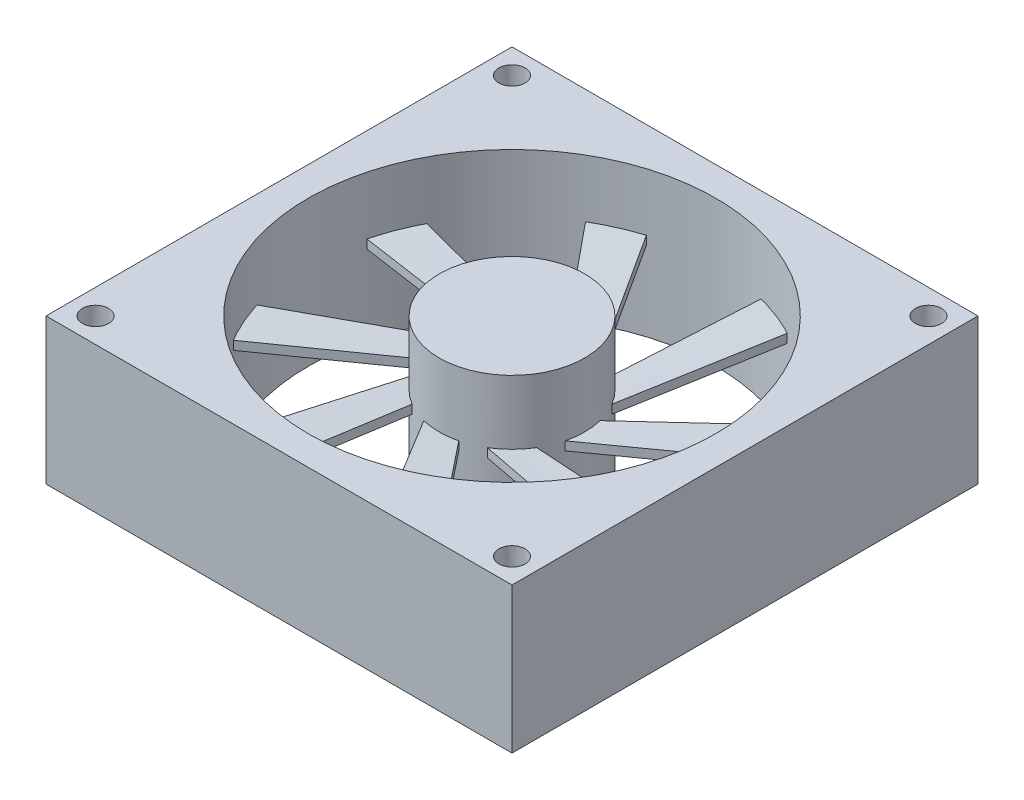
ISO-10303-21;
HEADER;
FILE_DESCRIPTION(('STEP AP214'),'2;1');
FILE_NAME('part.step','',(''),(''),'','','');
FILE_SCHEMA(('AUTOMOTIVE_DESIGN { 1 0 10303 214 1 1 1 1 }'));
ENDSEC;
DATA;
#1=APPLICATION_CONTEXT('core data for automotive mechanical design processes');
#2=APPLICATION_PROTOCOL_DEFINITION('international standard','automotive_design',2000,#1);
#3=PRODUCT_CONTEXT('',#1,'mechanical');
#4=PRODUCT('Part','Part','',(#3));
#5=PRODUCT_RELATED_PRODUCT_CATEGORY('part','',(#4));
#6=PRODUCT_DEFINITION_FORMATION('','',#4);
#7=PRODUCT_DEFINITION_CONTEXT('part definition',#1,'design');
#8=PRODUCT_DEFINITION('design','',#6,#7);
#9=PRODUCT_DEFINITION_SHAPE('','',#8);
#10=(LENGTH_UNIT() NAMED_UNIT(*) SI_UNIT(.MILLI.,.METRE.));
#11=(NAMED_UNIT(*) PLANE_ANGLE_UNIT() SI_UNIT($,.RADIAN.));
#12=(NAMED_UNIT(*) SI_UNIT($,.STERADIAN.) SOLID_ANGLE_UNIT());
#13=UNCERTAINTY_MEASURE_WITH_UNIT(LENGTH_MEASURE(1.E-05),#10,'distance_accuracy_value','');
#14=(GEOMETRIC_REPRESENTATION_CONTEXT(3) GLOBAL_UNCERTAINTY_ASSIGNED_CONTEXT((#13)) GLOBAL_UNIT_ASSIGNED_CONTEXT((#10,
#11,#12)) REPRESENTATION_CONTEXT('',''));
#15=CARTESIAN_POINT('',(0.,0.,0.));
#16=DIRECTION('',(0.,0.,1.));
#17=DIRECTION('',(1.,0.,0.));
#18=AXIS2_PLACEMENT_3D('',#15,#16,#17);
#19=CARTESIAN_POINT('',(0.,12.5,0.));
#20=DIRECTION('',(0.,1.,0.));
#21=DIRECTION('',(0.,0.,1.));
#22=AXIS2_PLACEMENT_3D('',#19,#20,#21);
#23=PLANE('',#22);
#24=CARTESIAN_POINT('',(0.,12.5,0.));
#25=DIRECTION('',(0.,1.,0.));
#26=DIRECTION('',(0.,0.,1.));
#27=AXIS2_PLACEMENT_3D('',#24,#25,#26);
#28=CIRCLE('',#27,35.);
#29=CARTESIAN_POINT('',(0.,12.5,35.));
#30=VERTEX_POINT('',#29);
#31=EDGE_CURVE('E112',#30,#30,#28,.T.);
#32=ORIENTED_EDGE('',*,*,#31,.F.);
#33=EDGE_LOOP('',(#32));
#34=FACE_BOUND('',#33,.T.);
#35=CARTESIAN_POINT('',(35.75,12.5,35.75));
#36=DIRECTION('',(0.,1.,0.));
#37=DIRECTION('',(0.,0.,1.));
#38=AXIS2_PLACEMENT_3D('',#35,#36,#37);
#39=CIRCLE('',#38,2.25);
#40=CARTESIAN_POINT('',(35.75,12.5,38.));
#41=VERTEX_POINT('',#40);
#42=EDGE_CURVE('E246',#41,#41,#39,.T.);
#43=ORIENTED_EDGE('',*,*,#42,.F.);
#44=EDGE_LOOP('',(#43));
#45=FACE_BOUND('',#44,.T.);
#46=CARTESIAN_POINT('',(35.75,12.5,-35.75));
#47=DIRECTION('',(0.,1.,0.));
#48=DIRECTION('',(0.,0.,-1.));
#49=AXIS2_PLACEMENT_3D('',#46,#47,#48);
#50=CIRCLE('',#49,2.25);
#51=CARTESIAN_POINT('',(35.75,12.5,-38.));
#52=VERTEX_POINT('',#51);
#53=EDGE_CURVE('E237',#52,#52,#50,.T.);
#54=ORIENTED_EDGE('',*,*,#53,.F.);
#55=EDGE_LOOP('',(#54));
#56=FACE_BOUND('',#55,.T.);
#57=DIRECTION('',(0.,0.,1.));
#58=VECTOR('',#57,1.);
#59=CARTESIAN_POINT('',(-40.,12.5,-40.));
#60=LINE('',#59,#58);
#61=CARTESIAN_POINT('',(-40.,12.5,-40.));
#62=VERTEX_POINT('',#61);
#63=CARTESIAN_POINT('',(-40.,12.5,40.));
#64=VERTEX_POINT('',#63);
#65=EDGE_CURVE('E211',#62,#64,#60,.T.);
#66=ORIENTED_EDGE('',*,*,#65,.T.);
#67=DIRECTION('',(1.,0.,0.));
#68=VECTOR('',#67,1.);
#69=CARTESIAN_POINT('',(-40.,12.5,40.));
#70=LINE('',#69,#68);
#71=CARTESIAN_POINT('',(40.,12.5,40.));
#72=VERTEX_POINT('',#71);
#73=EDGE_CURVE('E204',#64,#72,#70,.T.);
#74=ORIENTED_EDGE('',*,*,#73,.T.);
#75=DIRECTION('',(0.,0.,-1.));
#76=VECTOR('',#75,1.);
#77=CARTESIAN_POINT('',(40.,12.5,-40.));
#78=LINE('',#77,#76);
#79=CARTESIAN_POINT('',(40.,12.5,-40.));
#80=VERTEX_POINT('',#79);
#81=EDGE_CURVE('E208',#72,#80,#78,.T.);
#82=ORIENTED_EDGE('',*,*,#81,.T.);
#83=DIRECTION('',(-1.,0.,0.));
#84=VECTOR('',#83,1.);
#85=CARTESIAN_POINT('',(-40.,12.5,-40.));
#86=LINE('',#85,#84);
#87=EDGE_CURVE('E227',#80,#62,#86,.T.);
#88=ORIENTED_EDGE('',*,*,#87,.T.);
#89=EDGE_LOOP('',(#66,#74,#82,#88));
#90=FACE_BOUND('',#89,.T.);
#91=CARTESIAN_POINT('',(-35.75,12.5,-35.75));
#92=DIRECTION('',(0.,1.,0.));
#93=DIRECTION('',(0.,0.,1.));
#94=AXIS2_PLACEMENT_3D('',#91,#92,#93);
#95=CIRCLE('',#94,2.25);
#96=CARTESIAN_POINT('',(-35.75,12.5,-33.5));
#97=VERTEX_POINT('',#96);
#98=EDGE_CURVE('E240',#97,#97,#95,.T.);
#99=ORIENTED_EDGE('',*,*,#98,.F.);
#100=EDGE_LOOP('',(#99));
#101=FACE_BOUND('',#100,.T.);
#102=CARTESIAN_POINT('',(-35.75,12.5,35.75));
#103=DIRECTION('',(0.,1.,0.));
#104=DIRECTION('',(0.,0.,-1.));
#105=AXIS2_PLACEMENT_3D('',#102,#103,#104);
#106=CIRCLE('',#105,2.25);
#107=CARTESIAN_POINT('',(-35.75,12.5,33.5));
#108=VERTEX_POINT('',#107);
#109=EDGE_CURVE('E175',#108,#108,#106,.T.);
#110=ORIENTED_EDGE('',*,*,#109,.F.);
#111=EDGE_LOOP('',(#110));
#112=FACE_BOUND('',#111,.T.);
#113=ADVANCED_FACE('F166',(#34,#45,#56,#90,#101,#112),#23,.T.);
#114=CARTESIAN_POINT('',(0.,-12.5,0.));
#115=DIRECTION('',(0.,1.,0.));
#116=DIRECTION('',(0.,0.,1.));
#117=AXIS2_PLACEMENT_3D('',#114,#115,#116);
#118=PLANE('',#117);
#119=CARTESIAN_POINT('',(0.,-12.5,0.));
#120=DIRECTION('',(0.,1.,0.));
#121=DIRECTION('',(0.,0.,1.));
#122=AXIS2_PLACEMENT_3D('',#119,#120,#121);
#123=CIRCLE('',#122,35.);
#124=CARTESIAN_POINT('',(0.,-12.5,35.));
#125=VERTEX_POINT('',#124);
#126=EDGE_CURVE('E169',#125,#125,#123,.T.);
#127=ORIENTED_EDGE('',*,*,#126,.T.);
#128=EDGE_LOOP('',(#127));
#129=FACE_BOUND('',#128,.T.);
#130=DIRECTION('',(0.,0.,1.));
#131=VECTOR('',#130,1.);
#132=CARTESIAN_POINT('',(-40.,-12.5,-40.));
#133=LINE('',#132,#131);
#134=CARTESIAN_POINT('',(-40.,-12.5,-40.));
#135=VERTEX_POINT('',#134);
#136=CARTESIAN_POINT('',(-40.,-12.5,40.));
#137=VERTEX_POINT('',#136);
#138=EDGE_CURVE('E254',#135,#137,#133,.T.);
#139=ORIENTED_EDGE('',*,*,#138,.F.);
#140=DIRECTION('',(-1.,0.,0.));
#141=VECTOR('',#140,1.);
#142=CARTESIAN_POINT('',(-40.,-12.5,-40.));
#143=LINE('',#142,#141);
#144=CARTESIAN_POINT('',(40.,-12.5,-40.));
#145=VERTEX_POINT('',#144);
#146=EDGE_CURVE('E183',#145,#135,#143,.T.);
#147=ORIENTED_EDGE('',*,*,#146,.F.);
#148=DIRECTION('',(0.,0.,-1.));
#149=VECTOR('',#148,1.);
#150=CARTESIAN_POINT('',(40.,-12.5,-40.));
#151=LINE('',#150,#149);
#152=CARTESIAN_POINT('',(40.,-12.5,40.));
#153=VERTEX_POINT('',#152);
#154=EDGE_CURVE('E222',#153,#145,#151,.T.);
#155=ORIENTED_EDGE('',*,*,#154,.F.);
#156=DIRECTION('',(1.,0.,0.));
#157=VECTOR('',#156,1.);
#158=CARTESIAN_POINT('',(-40.,-12.5,40.));
#159=LINE('',#158,#157);
#160=EDGE_CURVE('E219',#137,#153,#159,.T.);
#161=ORIENTED_EDGE('',*,*,#160,.F.);
#162=EDGE_LOOP('',(#139,#147,#155,#161));
#163=FACE_BOUND('',#162,.T.);
#164=CARTESIAN_POINT('',(35.75,-12.5,-35.75));
#165=DIRECTION('',(0.,1.,0.));
#166=DIRECTION('',(0.,0.,-1.));
#167=AXIS2_PLACEMENT_3D('',#164,#165,#166);
#168=CIRCLE('',#167,2.25);
#169=CARTESIAN_POINT('',(35.75,-12.5,-38.));
#170=VERTEX_POINT('',#169);
#171=EDGE_CURVE('E233',#170,#170,#168,.T.);
#172=ORIENTED_EDGE('',*,*,#171,.T.);
#173=EDGE_LOOP('',(#172));
#174=FACE_BOUND('',#173,.T.);
#175=CARTESIAN_POINT('',(-35.75,-12.5,-35.75));
#176=DIRECTION('',(0.,1.,0.));
#177=DIRECTION('',(0.,0.,1.));
#178=AXIS2_PLACEMENT_3D('',#175,#176,#177);
#179=CIRCLE('',#178,2.25);
#180=CARTESIAN_POINT('',(-35.75,-12.5,-33.5));
#181=VERTEX_POINT('',#180);
#182=EDGE_CURVE('E236',#181,#181,#179,.T.);
#183=ORIENTED_EDGE('',*,*,#182,.T.);
#184=EDGE_LOOP('',(#183));
#185=FACE_BOUND('',#184,.T.);
#186=CARTESIAN_POINT('',(35.75,-12.5,35.75));
#187=DIRECTION('',(0.,1.,0.));
#188=DIRECTION('',(0.,0.,1.));
#189=AXIS2_PLACEMENT_3D('',#186,#187,#188);
#190=CIRCLE('',#189,2.25);
#191=CARTESIAN_POINT('',(35.75,-12.5,38.));
#192=VERTEX_POINT('',#191);
#193=EDGE_CURVE('E243',#192,#192,#190,.T.);
#194=ORIENTED_EDGE('',*,*,#193,.T.);
#195=EDGE_LOOP('',(#194));
#196=FACE_BOUND('',#195,.T.);
#197=CARTESIAN_POINT('',(-35.75,-12.5,35.75));
#198=DIRECTION('',(0.,1.,0.));
#199=DIRECTION('',(0.,0.,-1.));
#200=AXIS2_PLACEMENT_3D('',#197,#198,#199);
#201=CIRCLE('',#200,2.25);
#202=CARTESIAN_POINT('',(-35.75,-12.5,33.5));
#203=VERTEX_POINT('',#202);
#204=EDGE_CURVE('E249',#203,#203,#201,.T.);
#205=ORIENTED_EDGE('',*,*,#204,.T.);
#206=EDGE_LOOP('',(#205));
#207=FACE_BOUND('',#206,.T.);
#208=ADVANCED_FACE('F262',(#129,#163,#174,#185,#196,#207),#118,.F.);
#209=CARTESIAN_POINT('',(-40.,12.5,-40.));
#210=DIRECTION('',(1.,0.,0.));
#211=DIRECTION('',(0.,0.,-1.));
#212=AXIS2_PLACEMENT_3D('',#209,#210,#211);
#213=PLANE('',#212);
#214=ORIENTED_EDGE('',*,*,#138,.T.);
#215=DIRECTION('',(0.,-1.,0.));
#216=VECTOR('',#215,1.);
#217=CARTESIAN_POINT('',(-40.,12.5,40.));
#218=LINE('',#217,#216);
#219=EDGE_CURVE('E317',#64,#137,#218,.T.);
#220=ORIENTED_EDGE('',*,*,#219,.F.);
#221=ORIENTED_EDGE('',*,*,#65,.F.);
#222=DIRECTION('',(0.,-1.,0.));
#223=VECTOR('',#222,1.);
#224=CARTESIAN_POINT('',(-40.,12.5,-40.));
#225=LINE('',#224,#223);
#226=EDGE_CURVE('E318',#62,#135,#225,.T.);
#227=ORIENTED_EDGE('',*,*,#226,.T.);
#228=EDGE_LOOP('',(#214,#220,#221,#227));
#229=FACE_BOUND('',#228,.T.);
#230=ADVANCED_FACE('F267',(#229),#213,.F.);
#231=CARTESIAN_POINT('',(-40.,12.5,40.));
#232=DIRECTION('',(0.,0.,-1.));
#233=DIRECTION('',(-1.,0.,0.));
#234=AXIS2_PLACEMENT_3D('',#231,#232,#233);
#235=PLANE('',#234);
#236=ORIENTED_EDGE('',*,*,#160,.T.);
#237=DIRECTION('',(0.,-1.,0.));
#238=VECTOR('',#237,1.);
#239=CARTESIAN_POINT('',(40.,12.5,40.));
#240=LINE('',#239,#238);
#241=EDGE_CURVE('E217',#72,#153,#240,.T.);
#242=ORIENTED_EDGE('',*,*,#241,.F.);
#243=ORIENTED_EDGE('',*,*,#73,.F.);
#244=ORIENTED_EDGE('',*,*,#219,.T.);
#245=EDGE_LOOP('',(#236,#242,#243,#244));
#246=FACE_BOUND('',#245,.T.);
#247=ADVANCED_FACE('F218',(#246),#235,.F.);
#248=CARTESIAN_POINT('',(40.,12.5,-40.));
#249=DIRECTION('',(-1.,0.,0.));
#250=DIRECTION('',(0.,0.,1.));
#251=AXIS2_PLACEMENT_3D('',#248,#249,#250);
#252=PLANE('',#251);
#253=ORIENTED_EDGE('',*,*,#154,.T.);
#254=DIRECTION('',(0.,-1.,0.));
#255=VECTOR('',#254,1.);
#256=CARTESIAN_POINT('',(40.,12.5,-40.));
#257=LINE('',#256,#255);
#258=EDGE_CURVE('E225',#80,#145,#257,.T.);
#259=ORIENTED_EDGE('',*,*,#258,.F.);
#260=ORIENTED_EDGE('',*,*,#81,.F.);
#261=ORIENTED_EDGE('',*,*,#241,.T.);
#262=EDGE_LOOP('',(#253,#259,#260,#261));
#263=FACE_BOUND('',#262,.T.);
#264=ADVANCED_FACE('F224',(#263),#252,.F.);
#265=CARTESIAN_POINT('',(-40.,12.5,-40.));
#266=DIRECTION('',(0.,0.,1.));
#267=DIRECTION('',(1.,0.,0.));
#268=AXIS2_PLACEMENT_3D('',#265,#266,#267);
#269=PLANE('',#268);
#270=ORIENTED_EDGE('',*,*,#146,.T.);
#271=ORIENTED_EDGE('',*,*,#226,.F.);
#272=ORIENTED_EDGE('',*,*,#87,.F.);
#273=ORIENTED_EDGE('',*,*,#258,.T.);
#274=EDGE_LOOP('',(#270,#271,#272,#273));
#275=FACE_BOUND('',#274,.T.);
#276=ADVANCED_FACE('F279',(#275),#269,.F.);
#277=CARTESIAN_POINT('',(35.75,12.5,-35.75));
#278=DIRECTION('',(0.,-1.,0.));
#279=DIRECTION('',(0.,0.,-1.));
#280=AXIS2_PLACEMENT_3D('',#277,#278,#279);
#281=CYLINDRICAL_SURFACE('',#280,2.25);
#282=ORIENTED_EDGE('',*,*,#53,.T.);
#283=EDGE_LOOP('',(#282));
#284=FACE_BOUND('',#283,.T.);
#285=ORIENTED_EDGE('',*,*,#171,.F.);
#286=EDGE_LOOP('',(#285));
#287=FACE_BOUND('',#286,.T.);
#288=ADVANCED_FACE('F275',(#284,#287),#281,.F.);
#289=CARTESIAN_POINT('',(-35.75,12.5,-35.75));
#290=DIRECTION('',(0.,-1.,0.));
#291=DIRECTION('',(0.,0.,-1.));
#292=AXIS2_PLACEMENT_3D('',#289,#290,#291);
#293=CYLINDRICAL_SURFACE('',#292,2.25);
#294=ORIENTED_EDGE('',*,*,#98,.T.);
#295=EDGE_LOOP('',(#294));
#296=FACE_BOUND('',#295,.T.);
#297=ORIENTED_EDGE('',*,*,#182,.F.);
#298=EDGE_LOOP('',(#297));
#299=FACE_BOUND('',#298,.T.);
#300=ADVANCED_FACE('F278',(#296,#299),#293,.F.);
#301=CARTESIAN_POINT('',(35.75,12.5,35.75));
#302=DIRECTION('',(0.,-1.,0.));
#303=DIRECTION('',(0.,0.,-1.));
#304=AXIS2_PLACEMENT_3D('',#301,#302,#303);
#305=CYLINDRICAL_SURFACE('',#304,2.25);
#306=ORIENTED_EDGE('',*,*,#42,.T.);
#307=EDGE_LOOP('',(#306));
#308=FACE_BOUND('',#307,.T.);
#309=ORIENTED_EDGE('',*,*,#193,.F.);
#310=EDGE_LOOP('',(#309));
#311=FACE_BOUND('',#310,.T.);
#312=ADVANCED_FACE('F291',(#308,#311),#305,.F.);
#313=CARTESIAN_POINT('',(-35.75,12.5,35.75));
#314=DIRECTION('',(0.,-1.,0.));
#315=DIRECTION('',(0.,0.,-1.));
#316=AXIS2_PLACEMENT_3D('',#313,#314,#315);
#317=CYLINDRICAL_SURFACE('',#316,2.25);
#318=ORIENTED_EDGE('',*,*,#109,.T.);
#319=EDGE_LOOP('',(#318));
#320=FACE_BOUND('',#319,.T.);
#321=ORIENTED_EDGE('',*,*,#204,.F.);
#322=EDGE_LOOP('',(#321));
#323=FACE_BOUND('',#322,.T.);
#324=ADVANCED_FACE('F258',(#320,#323),#317,.F.);
#325=CARTESIAN_POINT('',(0.,-12.5,0.));
#326=DIRECTION('',(0.,1.,0.));
#327=DIRECTION('',(0.,0.,1.));
#328=AXIS2_PLACEMENT_3D('',#325,#326,#327);
#329=CYLINDRICAL_SURFACE('',#328,35.);
#330=ORIENTED_EDGE('',*,*,#126,.F.);
#331=EDGE_LOOP('',(#330));
#332=FACE_BOUND('',#331,.T.);
#333=ORIENTED_EDGE('',*,*,#31,.T.);
#334=EDGE_LOOP('',(#333));
#335=FACE_BOUND('',#334,.T.);
#336=ADVANCED_FACE('F290',(#332,#335),#329,.F.);
#337=CLOSED_SHELL('',(#113,#208,#230,#247,#264,#276,#288,#300,#312,#324,#336));
#338=MANIFOLD_SOLID_BREP('B8',#337);
#339=CARTESIAN_POINT('',(-4.11453010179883,0.,3.3215061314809));
#340=DIRECTION('',(0.77810460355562,0.,-0.62813471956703));
#341=DIRECTION('',(-0.62813471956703,0.,-0.77810460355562));
#342=AXIS2_PLACEMENT_3D('',#339,#340,#341);
#343=PLANE('',#342);
#344=DIRECTION('',(0.627472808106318,0.0458959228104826,0.777284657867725));
#345=VECTOR('',#344,1.);
#346=CARTESIAN_POINT('',(3.00000000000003,1.5,12.1346610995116));
#347=LINE('',#346,#345);
#348=CARTESIAN_POINT('',(3.00000000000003,1.5,12.1346610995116));
#349=VERTEX_POINT('',#348);
#350=CARTESIAN_POINT('',(25.4946450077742,3.14535016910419,40.));
#351=VERTEX_POINT('',#350);
#352=EDGE_CURVE('E747',#349,#351,#347,.T.);
#353=ORIENTED_EDGE('',*,*,#352,.T.);
#354=DIRECTION('',(0.,-1.,0.));
#355=VECTOR('',#354,1.);
#356=CARTESIAN_POINT('',(25.4946450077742,0.,40.));
#357=LINE('',#356,#355);
#358=CARTESIAN_POINT('',(25.4946450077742,1.64535016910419,40.));
#359=VERTEX_POINT('',#358);
#360=EDGE_CURVE('E1665',#351,#359,#357,.T.);
#361=ORIENTED_EDGE('',*,*,#360,.T.);
#362=DIRECTION('',(0.627472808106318,0.0458959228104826,0.777284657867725));
#363=VECTOR('',#362,1.);
#364=CARTESIAN_POINT('',(16.6716459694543,1.,29.0704717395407));
#365=LINE('',#364,#363);
#366=CARTESIAN_POINT('',(3.00000000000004,0.,12.1346610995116));
#367=VERTEX_POINT('',#366);
#368=EDGE_CURVE('E756',#367,#359,#365,.T.);
#369=ORIENTED_EDGE('',*,*,#368,.F.);
#370=DIRECTION('',(0.,-1.,0.));
#371=VECTOR('',#370,1.);
#372=CARTESIAN_POINT('',(3.00000000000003,-12.5,12.1346610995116));
#373=LINE('',#372,#371);
#374=EDGE_CURVE('E767',#349,#367,#373,.T.);
#375=ORIENTED_EDGE('',*,*,#374,.F.);
#376=EDGE_LOOP('',(#353,#361,#369,#375));
#377=FACE_BOUND('',#376,.T.);
#378=ADVANCED_FACE('F394',(#377),#343,.T.);
#379=CARTESIAN_POINT('',(-2.99999999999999,0.,12.1346610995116));
#380=CARTESIAN_POINT('',(21.2845500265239,2.,50.8356303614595));
#381=CARTESIAN_POINT('',(-1.01987194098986,0.,12.6241996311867));
#382=CARTESIAN_POINT('',(24.4501058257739,2.,49.5102325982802));
#383=CARTESIAN_POINT('',(1.01987194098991,0.,12.6241996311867));
#384=CARTESIAN_POINT('',(27.4784616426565,2.,47.8957717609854));
#385=CARTESIAN_POINT('',(3.00000000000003,0.,12.1346610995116));
#386=CARTESIAN_POINT('',(30.3432919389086,2.,46.0062823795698));
#387=(BOUNDED_SURFACE() B_SPLINE_SURFACE(3,1,((#379,#380),(#381,#382),(#383,#384),(#385,#386)),
.UNSPECIFIED.,.F.,.F.,.F.) B_SPLINE_SURFACE_WITH_KNOTS((4,4),(2,2),(0.,1.),(0.,1.),
.UNSPECIFIED.) GEOMETRIC_REPRESENTATION_ITEM() RATIONAL_B_SPLINE_SURFACE(((1.,1.),
(0.980515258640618,0.997102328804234),(0.980515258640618,0.997102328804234),(1.,1.))) REPRESENTATION_ITEM('') SURFACE());
#388=CARTESIAN_POINT('',(25.4946450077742,1.64535016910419,40.));
#389=CARTESIAN_POINT('',(24.577313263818,1.62328535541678,40.));
#390=CARTESIAN_POINT('',(23.6599545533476,1.60231627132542,40.));
#391=CARTESIAN_POINT('',(21.8251852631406,1.56279024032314,40.));
#392=CARTESIAN_POINT('',(20.9077746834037,1.544233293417,40.));
#393=CARTESIAN_POINT('',(19.0728793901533,1.50975175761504,40.));
#394=CARTESIAN_POINT('',(18.1553946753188,1.49382723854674,40.));
#395=CARTESIAN_POINT('',(16.3203725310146,1.46478325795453,40.));
#396=CARTESIAN_POINT('',(15.4028351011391,1.45166382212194,40.));
#397=CARTESIAN_POINT('',(14.4852782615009,1.44003312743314,40.));
#398=B_SPLINE_CURVE_WITH_KNOTS('',3,(#388,#389,#390,#391,#392,#393,#394,#395,#396,#397),
.UNSPECIFIED.,.F.,.F.,(4,2,2,2,4),(0.,2.75279145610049,5.50558291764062,8.25844738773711,
11.0113370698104),.UNSPECIFIED.);
#399=CARTESIAN_POINT('',(14.4852782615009,1.44003312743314,40.));
#400=VERTEX_POINT('',#399);
#401=EDGE_CURVE('E700',#359,#400,#398,.T.);
#402=DIRECTION('',(0.531007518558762,0.0437321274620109,0.846237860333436));
#403=VECTOR('',#402,1.);
#404=CARTESIAN_POINT('',(-2.99999999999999,0.,12.1346610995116));
#405=LINE('',#404,#403);
#406=CARTESIAN_POINT('',(-2.99999999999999,0.,12.1346610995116));
#407=VERTEX_POINT('',#406);
#408=EDGE_CURVE('E764',#407,#400,#405,.T.);
#409=CARTESIAN_POINT('',(0.,0.,0.));
#410=DIRECTION('',(0.,-1.,0.));
#411=DIRECTION('',(-1.,0.,0.));
#412=AXIS2_PLACEMENT_3D('',#409,#410,#411);
#413=CIRCLE('',#412,12.5);
#414=EDGE_CURVE('E797',#367,#407,#413,.T.);
#415=ORIENTED_EDGE('',*,*,#368,.T.);
#416=ORIENTED_EDGE('',*,*,#401,.T.);
#417=ORIENTED_EDGE('',*,*,#408,.F.);
#418=ORIENTED_EDGE('',*,*,#414,.F.);
#419=EDGE_LOOP('',(#415,#416,#417,#418));
#420=FACE_BOUND('',#419,.T.);
#421=ADVANCED_FACE('F714',(#420),#387,.T.);
#422=CARTESIAN_POINT('',(3.00000000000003,1.5,12.1346610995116));
#423=CARTESIAN_POINT('',(30.3432919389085,3.5,46.0062823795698));
#424=CARTESIAN_POINT('',(1.0198719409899,1.5,12.6241996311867));
#425=CARTESIAN_POINT('',(27.4784616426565,3.5,47.8957717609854));
#426=CARTESIAN_POINT('',(-1.01987194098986,1.5,12.6241996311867));
#427=CARTESIAN_POINT('',(24.4501058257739,3.5,49.5102325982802));
#428=CARTESIAN_POINT('',(-2.99999999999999,1.5,12.1346610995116));
#429=CARTESIAN_POINT('',(21.2845500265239,3.5,50.8356303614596));
#430=(BOUNDED_SURFACE() B_SPLINE_SURFACE(3,1,((#422,#423),(#424,#425),(#426,#427),(#428,#429)),
.UNSPECIFIED.,.F.,.F.,.F.) B_SPLINE_SURFACE_WITH_KNOTS((4,4),(2,2),(0.,1.),(0.,1.),
.UNSPECIFIED.) GEOMETRIC_REPRESENTATION_ITEM() RATIONAL_B_SPLINE_SURFACE(((1.,1.),
(0.980515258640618,0.997102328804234),(0.980515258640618,0.997102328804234),(1.,1.))) REPRESENTATION_ITEM('') SURFACE());
#431=DIRECTION('',(0.531007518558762,0.0437321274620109,0.846237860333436));
#432=VECTOR('',#431,1.);
#433=CARTESIAN_POINT('',(-2.99999999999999,1.5,12.1346610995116));
#434=LINE('',#433,#432);
#435=CARTESIAN_POINT('',(-3.,1.5,12.1346610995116));
#436=VERTEX_POINT('',#435);
#437=CARTESIAN_POINT('',(14.4852782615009,2.94003312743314,40.));
#438=VERTEX_POINT('',#437);
#439=EDGE_CURVE('E761',#436,#438,#434,.T.);
#440=CARTESIAN_POINT('',(14.4852782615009,2.94003312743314,40.));
#441=CARTESIAN_POINT('',(15.4027970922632,2.95165512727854,40.));
#442=CARTESIAN_POINT('',(16.3202960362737,2.9647773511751,40.));
#443=CARTESIAN_POINT('',(18.6140152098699,3.00109314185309,40.));
#444=CARTESIAN_POINT('',(19.9902078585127,3.02604173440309,40.));
#445=CARTESIAN_POINT('',(22.7425034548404,3.0816072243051,40.));
#446=CARTESIAN_POINT('',(24.1186064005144,3.11222422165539,40.));
#447=CARTESIAN_POINT('',(25.4946450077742,3.14535016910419,40.));
#448=B_SPLINE_CURVE_WITH_KNOTS('',3,(#440,#441,#442,#443,#444,#445,#446,#447),.UNSPECIFIED.,.F.,
.F.,(4,2,2,4),(0.,2.7527747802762,6.88201787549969,11.0113338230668),.UNSPECIFIED.);
#449=EDGE_CURVE('E409',#438,#351,#448,.T.);
#450=CARTESIAN_POINT('',(0.,1.5,0.));
#451=DIRECTION('',(0.,1.,0.));
#452=DIRECTION('',(1.,0.,0.));
#453=AXIS2_PLACEMENT_3D('',#450,#451,#452);
#454=CIRCLE('',#453,12.5);
#455=EDGE_CURVE('E794',#436,#349,#454,.T.);
#456=ORIENTED_EDGE('',*,*,#439,.T.);
#457=ORIENTED_EDGE('',*,*,#449,.T.);
#458=ORIENTED_EDGE('',*,*,#352,.F.);
#459=ORIENTED_EDGE('',*,*,#455,.F.);
#460=EDGE_LOOP('',(#456,#457,#458,#459));
#461=FACE_BOUND('',#460,.T.);
#462=ADVANCED_FACE('F707',(#461),#430,.T.);
#463=CARTESIAN_POINT('',(-7.61573576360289,0.,4.77881354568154));
#464=DIRECTION('',(-0.847048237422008,0.,0.531516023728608));
#465=DIRECTION('',(0.531516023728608,0.,0.847048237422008));
#466=AXIS2_PLACEMENT_3D('',#463,#464,#465);
#467=PLANE('',#466);
#468=ORIENTED_EDGE('',*,*,#408,.T.);
#469=DIRECTION('',(0.,1.,0.));
#470=VECTOR('',#469,1.);
#471=CARTESIAN_POINT('',(14.4852782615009,0.,40.));
#472=LINE('',#471,#470);
#473=EDGE_CURVE('E701',#400,#438,#472,.T.);
#474=ORIENTED_EDGE('',*,*,#473,.T.);
#475=ORIENTED_EDGE('',*,*,#439,.F.);
#476=DIRECTION('',(0.,1.,0.));
#477=VECTOR('',#476,1.);
#478=CARTESIAN_POINT('',(-2.99999999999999,-12.5,12.1346610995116));
#479=LINE('',#478,#477);
#480=EDGE_CURVE('E774',#407,#436,#479,.T.);
#481=ORIENTED_EDGE('',*,*,#480,.F.);
#482=EDGE_LOOP('',(#468,#474,#475,#481));
#483=FACE_BOUND('',#482,.T.);
#484=ADVANCED_FACE('F713',(#483),#467,.T.);
#485=CARTESIAN_POINT('',(-0.560752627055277,0.,5.25807164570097));
#486=DIRECTION('',(0.106044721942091,0.,-0.994361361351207));
#487=DIRECTION('',(-0.994361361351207,0.,-0.106044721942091));
#488=AXIS2_PLACEMENT_3D('',#485,#486,#487);
#489=PLANE('',#488);
#490=DIRECTION('',(0.993313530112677,0.0458959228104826,0.10593297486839));
#491=VECTOR('',#490,1.);
#492=CARTESIAN_POINT('',(10.7018214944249,1.5,6.45918080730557));
#493=LINE('',#492,#491);
#494=CARTESIAN_POINT('',(10.7018214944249,1.5,6.45918080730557));
#495=VERTEX_POINT('',#494);
#496=CARTESIAN_POINT('',(40.,2.85371853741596,9.58371612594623));
#497=VERTEX_POINT('',#496);
#498=EDGE_CURVE('E799',#495,#497,#493,.T.);
#499=ORIENTED_EDGE('',*,*,#498,.T.);
#500=DIRECTION('',(0.,-1.,0.));
#501=VECTOR('',#500,1.);
#502=CARTESIAN_POINT('',(40.,0.,9.58371612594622));
#503=LINE('',#502,#501);
#504=CARTESIAN_POINT('',(40.,1.35371853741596,9.5837161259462));
#505=VERTEX_POINT('',#504);
#506=EDGE_CURVE('E1676',#497,#505,#503,.T.);
#507=ORIENTED_EDGE('',*,*,#506,.T.);
#508=DIRECTION('',(0.993313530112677,0.0458959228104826,0.105932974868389));
#509=VECTOR('',#508,1.);
#510=CARTESIAN_POINT('',(32.3445616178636,1.,8.76729378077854));
#511=LINE('',#510,#509);
#512=CARTESIAN_POINT('',(10.7018214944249,0.,6.45918080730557));
#513=VERTEX_POINT('',#512);
#514=EDGE_CURVE('E1866',#513,#505,#511,.T.);
#515=ORIENTED_EDGE('',*,*,#514,.F.);
#516=DIRECTION('',(0.,-1.,0.));
#517=VECTOR('',#516,1.);
#518=CARTESIAN_POINT('',(10.7018214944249,-12.5,6.45918080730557));
#519=LINE('',#518,#517);
#520=EDGE_CURVE('E818',#495,#513,#519,.T.);
#521=ORIENTED_EDGE('',*,*,#520,.F.);
#522=EDGE_LOOP('',(#499,#507,#515,#521));
#523=FACE_BOUND('',#522,.T.);
#524=ADVANCED_FACE('F1361',(#523),#489,.T.);
#525=CARTESIAN_POINT('',(6.45918080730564,0.,10.7018214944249));
#526=CARTESIAN_POINT('',(50.9966686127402,2.,20.8957692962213));
#527=CARTESIAN_POINT('',(8.20549880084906,0.,9.64781553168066));
#528=CARTESIAN_POINT('',(52.2978568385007,2.,17.7201855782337));
#529=CARTESIAN_POINT('',(9.64781553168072,0.,8.20549880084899));
#530=CARTESIAN_POINT('',(53.2976315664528,2.,14.4372184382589));
#531=CARTESIAN_POINT('',(10.7018214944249,0.,6.45918080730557));
#532=CARTESIAN_POINT('',(53.9873017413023,2.,11.0754067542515));
#533=(BOUNDED_SURFACE() B_SPLINE_SURFACE(3,1,((#525,#526),(#527,#528),(#529,#530),(#531,#532)),
.UNSPECIFIED.,.F.,.F.,.F.) B_SPLINE_SURFACE_WITH_KNOTS((4,4),(2,2),(0.,1.),(0.,1.),
.UNSPECIFIED.) GEOMETRIC_REPRESENTATION_ITEM() RATIONAL_B_SPLINE_SURFACE(((1.,1.),
(0.980515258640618,0.997102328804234),(0.980515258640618,0.997102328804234),(1.,1.))) REPRESENTATION_ITEM('') SURFACE());
#534=CARTESIAN_POINT('',(40.,1.35371853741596,9.5837161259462));
#535=CARTESIAN_POINT('',(40.,1.36460257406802,10.4416054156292));
#536=CARTESIAN_POINT('',(40.,1.37683632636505,11.2994761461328));
#537=CARTESIAN_POINT('',(40.,1.40368159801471,13.0151803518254));
#538=CARTESIAN_POINT('',(40.,1.41829311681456,13.873013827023));
#539=CARTESIAN_POINT('',(40.,1.45610315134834,15.9468565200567));
#540=CARTESIAN_POINT('',(40.,1.48033954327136,17.1628470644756));
#541=CARTESIAN_POINT('',(40.,1.50618370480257,18.3788005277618));
#542=B_SPLINE_CURVE_WITH_KNOTS('',3,(#534,#535,#536,#537,#538,#539,#540,#541),.UNSPECIFIED.,.F.,
.F.,(4,2,2,4),(0.,2.57387161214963,5.14774262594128,8.79642977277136),.UNSPECIFIED.);
#543=CARTESIAN_POINT('',(40.,1.50618370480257,18.3788005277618));
#544=VERTEX_POINT('',#543);
#545=EDGE_CURVE('E1896',#505,#544,#542,.T.);
#546=DIRECTION('',(0.97385954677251,0.0437321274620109,0.222901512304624));
#547=VECTOR('',#546,1.);
#548=CARTESIAN_POINT('',(6.45918080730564,0.,10.7018214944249));
#549=LINE('',#548,#547);
#550=CARTESIAN_POINT('',(6.45918080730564,0.,10.7018214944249));
#551=VERTEX_POINT('',#550);
#552=EDGE_CURVE('E834',#551,#544,#549,.T.);
#553=CARTESIAN_POINT('',(0.,0.,0.));
#554=DIRECTION('',(0.,-1.,0.));
#555=DIRECTION('',(-0.707106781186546,0.,0.707106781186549));
#556=AXIS2_PLACEMENT_3D('',#553,#554,#555);
#557=CIRCLE('',#556,12.5);
#558=EDGE_CURVE('E835',#513,#551,#557,.T.);
#559=ORIENTED_EDGE('',*,*,#514,.T.);
#560=ORIENTED_EDGE('',*,*,#545,.T.);
#561=ORIENTED_EDGE('',*,*,#552,.F.);
#562=ORIENTED_EDGE('',*,*,#558,.F.);
#563=EDGE_LOOP('',(#559,#560,#561,#562));
#564=FACE_BOUND('',#563,.T.);
#565=ADVANCED_FACE('F1353',(#564),#533,.T.);
#566=CARTESIAN_POINT('',(10.7018214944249,1.5,6.45918080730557));
#567=CARTESIAN_POINT('',(53.9873017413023,3.5,11.0754067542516));
#568=CARTESIAN_POINT('',(9.64781553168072,1.5,8.20549880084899));
#569=CARTESIAN_POINT('',(53.2976315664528,3.5,14.437218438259));
#570=CARTESIAN_POINT('',(8.20549880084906,1.5,9.64781553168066));
#571=CARTESIAN_POINT('',(52.2978568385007,3.5,17.7201855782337));
#572=CARTESIAN_POINT('',(6.45918080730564,1.5,10.7018214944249));
#573=CARTESIAN_POINT('',(50.9966686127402,3.5,20.8957692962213));
#574=(BOUNDED_SURFACE() B_SPLINE_SURFACE(3,1,((#566,#567),(#568,#569),(#570,#571),(#572,#573)),
.UNSPECIFIED.,.F.,.F.,.F.) B_SPLINE_SURFACE_WITH_KNOTS((4,4),(2,2),(0.,1.),(0.,1.),
.UNSPECIFIED.) GEOMETRIC_REPRESENTATION_ITEM() RATIONAL_B_SPLINE_SURFACE(((1.,1.),
(0.980515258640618,0.997102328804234),(0.980515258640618,0.997102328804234),(1.,1.))) REPRESENTATION_ITEM('') SURFACE());
#575=DIRECTION('',(0.97385954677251,0.0437321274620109,0.222901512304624));
#576=VECTOR('',#575,1.);
#577=CARTESIAN_POINT('',(6.45918080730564,1.5,10.7018214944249));
#578=LINE('',#577,#576);
#579=CARTESIAN_POINT('',(6.45918080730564,1.5,10.7018214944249));
#580=VERTEX_POINT('',#579);
#581=CARTESIAN_POINT('',(40.,3.00618370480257,18.3788005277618));
#582=VERTEX_POINT('',#581);
#583=EDGE_CURVE('E1859',#580,#582,#578,.T.);
#584=CARTESIAN_POINT('',(40.,3.00618370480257,18.3788005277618));
#585=CARTESIAN_POINT('',(40.,2.98796067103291,17.5210378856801));
#586=CARTESIAN_POINT('',(40.,2.97053055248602,16.6632573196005));
#587=CARTESIAN_POINT('',(40.,2.9375862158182,14.9476593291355));
#588=CARTESIAN_POINT('',(40.,2.92207199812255,14.089841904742));
#589=CARTESIAN_POINT('',(40.,2.88727993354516,12.0159472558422));
#590=CARTESIAN_POINT('',(40.,2.86913580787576,10.7998511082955));
#591=CARTESIAN_POINT('',(40.,2.85371853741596,9.58371612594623));
#592=B_SPLINE_CURVE_WITH_KNOTS('',3,(#584,#585,#586,#587,#588,#589,#590,#591),.UNSPECIFIED.,.F.,
.F.,(4,2,2,4),(0.,2.57386997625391,5.14774052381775,8.79642919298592),.UNSPECIFIED.);
#593=EDGE_CURVE('E417',#582,#497,#592,.T.);
#594=CARTESIAN_POINT('',(0.,1.5,0.));
#595=DIRECTION('',(0.,1.,0.));
#596=DIRECTION('',(0.707106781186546,0.,-0.707106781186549));
#597=AXIS2_PLACEMENT_3D('',#594,#595,#596);
#598=CIRCLE('',#597,12.5);
#599=EDGE_CURVE('E823',#580,#495,#598,.T.);
#600=ORIENTED_EDGE('',*,*,#583,.T.);
#601=ORIENTED_EDGE('',*,*,#593,.T.);
#602=ORIENTED_EDGE('',*,*,#498,.F.);
#603=ORIENTED_EDGE('',*,*,#599,.F.);
#604=EDGE_LOOP('',(#600,#601,#602,#603));
#605=FACE_BOUND('',#604,.T.);
#606=ADVANCED_FACE('F1345',(#605),#574,.T.);
#607=CARTESIAN_POINT('',(-2.00600693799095,0.,8.76426986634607));
#608=DIRECTION('',(-0.223114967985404,0.,0.974792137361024));
#609=DIRECTION('',(0.974792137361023,0.,0.223114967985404));
#610=AXIS2_PLACEMENT_3D('',#607,#608,#609);
#611=PLANE('',#610);
#612=ORIENTED_EDGE('',*,*,#552,.T.);
#613=DIRECTION('',(0.,1.,0.));
#614=VECTOR('',#613,1.);
#615=CARTESIAN_POINT('',(40.,0.,18.3788005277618));
#616=LINE('',#615,#614);
#617=EDGE_CURVE('E1906',#544,#582,#616,.T.);
#618=ORIENTED_EDGE('',*,*,#617,.T.);
#619=ORIENTED_EDGE('',*,*,#583,.F.);
#620=DIRECTION('',(0.,1.,0.));
#621=VECTOR('',#620,1.);
#622=CARTESIAN_POINT('',(6.45918080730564,-12.5,10.7018214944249));
#623=LINE('',#622,#621);
#624=EDGE_CURVE('E806',#551,#580,#623,.T.);
#625=ORIENTED_EDGE('',*,*,#624,.F.);
#626=EDGE_LOOP('',(#612,#618,#619,#625));
#627=FACE_BOUND('',#626,.T.);
#628=ADVANCED_FACE('F1337',(#627),#611,.T.);
#629=CARTESIAN_POINT('',(3.32150613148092,0.,4.11453010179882));
#630=DIRECTION('',(-0.628134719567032,0.,-0.778104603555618));
#631=DIRECTION('',(-0.778104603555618,0.,0.628134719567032));
#632=AXIS2_PLACEMENT_3D('',#629,#630,#631);
#633=PLANE('',#632);
#634=DIRECTION('',(0.777284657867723,0.0458959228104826,-0.62747280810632));
#635=VECTOR('',#634,1.);
#636=CARTESIAN_POINT('',(12.1346610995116,1.5,-3.00000000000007));
#637=LINE('',#636,#635);
#638=CARTESIAN_POINT('',(12.1346610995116,1.5,-3.00000000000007));
#639=VERTEX_POINT('',#638);
#640=CARTESIAN_POINT('',(40.,3.14535016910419,-25.4946450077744));
#641=VERTEX_POINT('',#640);
#642=EDGE_CURVE('E1820',#639,#641,#637,.T.);
#643=ORIENTED_EDGE('',*,*,#642,.T.);
#644=DIRECTION('',(0.,-1.,0.));
#645=VECTOR('',#644,1.);
#646=CARTESIAN_POINT('',(40.,0.,-25.4946450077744));
#647=LINE('',#646,#645);
#648=CARTESIAN_POINT('',(40.,1.6453501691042,-25.4946450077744));
#649=VERTEX_POINT('',#648);
#650=EDGE_CURVE('E1807',#641,#649,#647,.T.);
#651=ORIENTED_EDGE('',*,*,#650,.T.);
#652=DIRECTION('',(0.777284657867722,0.0458959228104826,-0.627472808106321));
#653=VECTOR('',#652,1.);
#654=CARTESIAN_POINT('',(29.0704717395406,1.,-16.6716459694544));
#655=LINE('',#654,#653);
#656=CARTESIAN_POINT('',(12.1346610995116,0.,-3.00000000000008));
#657=VERTEX_POINT('',#656);
#658=EDGE_CURVE('E1818',#657,#649,#655,.T.);
#659=ORIENTED_EDGE('',*,*,#658,.F.);
#660=DIRECTION('',(0.,-1.,0.));
#661=VECTOR('',#660,1.);
#662=CARTESIAN_POINT('',(12.1346610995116,-12.5,-3.00000000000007));
#663=LINE('',#662,#661);
#664=EDGE_CURVE('E860',#639,#657,#663,.T.);
#665=ORIENTED_EDGE('',*,*,#664,.F.);
#666=EDGE_LOOP('',(#643,#651,#659,#665));
#667=FACE_BOUND('',#666,.T.);
#668=ADVANCED_FACE('F1329',(#667),#633,.T.);
#669=CARTESIAN_POINT('',(12.1346610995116,0.,2.99999999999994));
#670=CARTESIAN_POINT('',(50.8356303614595,2.,-21.2845500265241));
#671=CARTESIAN_POINT('',(12.6241996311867,0.,1.01987194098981));
#672=CARTESIAN_POINT('',(49.5102325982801,2.,-24.4501058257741));
#673=CARTESIAN_POINT('',(12.6241996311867,0.,-1.01987194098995));
#674=CARTESIAN_POINT('',(47.8957717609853,2.,-27.4784616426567));
#675=CARTESIAN_POINT('',(12.1346610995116,0.,-3.00000000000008));
#676=CARTESIAN_POINT('',(46.0062823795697,2.,-30.3432919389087));
#677=(BOUNDED_SURFACE() B_SPLINE_SURFACE(3,1,((#669,#670),(#671,#672),(#673,#674),(#675,#676)),
.UNSPECIFIED.,.F.,.F.,.F.) B_SPLINE_SURFACE_WITH_KNOTS((4,4),(2,2),(0.,1.),(0.,1.),
.UNSPECIFIED.) GEOMETRIC_REPRESENTATION_ITEM() RATIONAL_B_SPLINE_SURFACE(((1.,1.),
(0.980515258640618,0.997102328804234),(0.980515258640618,0.997102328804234),(1.,1.))) REPRESENTATION_ITEM('') SURFACE());
#678=CARTESIAN_POINT('',(40.,1.6453501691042,-25.4946450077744));
#679=CARTESIAN_POINT('',(40.,1.62328535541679,-24.5773132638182));
#680=CARTESIAN_POINT('',(40.,1.60231627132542,-23.6599545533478));
#681=CARTESIAN_POINT('',(40.,1.56279024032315,-21.8251852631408));
#682=CARTESIAN_POINT('',(40.,1.544233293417,-20.9077746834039));
#683=CARTESIAN_POINT('',(40.,1.50975175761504,-19.0728793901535));
#684=CARTESIAN_POINT('',(40.,1.49382723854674,-18.155394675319));
#685=CARTESIAN_POINT('',(40.,1.46478325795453,-16.3203725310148));
#686=CARTESIAN_POINT('',(40.,1.45166382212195,-15.4028351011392));
#687=CARTESIAN_POINT('',(40.,1.44003312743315,-14.4852782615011));
#688=B_SPLINE_CURVE_WITH_KNOTS('',3,(#678,#679,#680,#681,#682,#683,#684,#685,#686,#687),
.UNSPECIFIED.,.F.,.F.,(4,2,2,2,4),(0.,2.75279145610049,5.50558291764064,8.25844738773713,
11.0113370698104),.UNSPECIFIED.);
#689=CARTESIAN_POINT('',(40.,1.44003312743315,-14.4852782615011));
#690=VERTEX_POINT('',#689);
#691=EDGE_CURVE('E1811',#649,#690,#688,.T.);
#692=DIRECTION('',(0.846237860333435,0.0437321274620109,-0.531007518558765));
#693=VECTOR('',#692,1.);
#694=CARTESIAN_POINT('',(12.1346610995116,0.,2.99999999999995));
#695=LINE('',#694,#693);
#696=CARTESIAN_POINT('',(12.1346610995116,0.,2.99999999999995));
#697=VERTEX_POINT('',#696);
#698=EDGE_CURVE('E876',#697,#690,#695,.T.);
#699=CARTESIAN_POINT('',(0.,0.,0.));
#700=DIRECTION('',(0.,-1.,0.));
#701=DIRECTION('',(0.,0.,1.));
#702=AXIS2_PLACEMENT_3D('',#699,#700,#701);
#703=CIRCLE('',#702,12.5);
#704=EDGE_CURVE('E877',#657,#697,#703,.T.);
#705=ORIENTED_EDGE('',*,*,#658,.T.);
#706=ORIENTED_EDGE('',*,*,#691,.T.);
#707=ORIENTED_EDGE('',*,*,#698,.F.);
#708=ORIENTED_EDGE('',*,*,#704,.F.);
#709=EDGE_LOOP('',(#705,#706,#707,#708));
#710=FACE_BOUND('',#709,.T.);
#711=ADVANCED_FACE('F1322',(#710),#677,.T.);
#712=CARTESIAN_POINT('',(12.1346610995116,1.5,-3.00000000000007));
#713=CARTESIAN_POINT('',(46.0062823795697,3.5,-30.3432919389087));
#714=CARTESIAN_POINT('',(12.6241996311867,1.5,-1.01987194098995));
#715=CARTESIAN_POINT('',(47.8957717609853,3.5,-27.4784616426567));
#716=CARTESIAN_POINT('',(12.6241996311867,1.5,1.01987194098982));
#717=CARTESIAN_POINT('',(49.5102325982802,3.5,-24.450105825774));
#718=CARTESIAN_POINT('',(12.1346610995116,1.5,2.99999999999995));
#719=CARTESIAN_POINT('',(50.8356303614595,3.5,-21.2845500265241));
#720=(BOUNDED_SURFACE() B_SPLINE_SURFACE(3,1,((#712,#713),(#714,#715),(#716,#717),(#718,#719)),
.UNSPECIFIED.,.F.,.F.,.F.) B_SPLINE_SURFACE_WITH_KNOTS((4,4),(2,2),(0.,1.),(0.,1.),
.UNSPECIFIED.) GEOMETRIC_REPRESENTATION_ITEM() RATIONAL_B_SPLINE_SURFACE(((1.,1.),
(0.980515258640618,0.997102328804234),(0.980515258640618,0.997102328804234),(1.,1.))) REPRESENTATION_ITEM('') SURFACE());
#721=DIRECTION('',(0.846237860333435,0.0437321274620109,-0.531007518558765));
#722=VECTOR('',#721,1.);
#723=CARTESIAN_POINT('',(12.1346610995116,1.5,2.99999999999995));
#724=LINE('',#723,#722);
#725=CARTESIAN_POINT('',(12.1346610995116,1.5,2.99999999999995));
#726=VERTEX_POINT('',#725);
#727=CARTESIAN_POINT('',(40.,2.94003312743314,-14.4852782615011));
#728=VERTEX_POINT('',#727);
#729=EDGE_CURVE('E1815',#726,#728,#724,.T.);
#730=CARTESIAN_POINT('',(40.,2.94003312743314,-14.4852782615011));
#731=CARTESIAN_POINT('',(40.,2.95165512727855,-15.4027970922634));
#732=CARTESIAN_POINT('',(40.,2.9647773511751,-16.3202960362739));
#733=CARTESIAN_POINT('',(40.,3.0010931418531,-18.6140152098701));
#734=CARTESIAN_POINT('',(40.,3.0260417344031,-19.9902078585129));
#735=CARTESIAN_POINT('',(40.,3.08160722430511,-22.7425034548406));
#736=CARTESIAN_POINT('',(40.,3.11222422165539,-24.1186064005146));
#737=CARTESIAN_POINT('',(40.,3.14535016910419,-25.4946450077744));
#738=B_SPLINE_CURVE_WITH_KNOTS('',3,(#730,#731,#732,#733,#734,#735,#736,#737),.UNSPECIFIED.,.F.,
.F.,(4,2,2,4),(0.,2.75277478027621,6.88201787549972,11.0113338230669),.UNSPECIFIED.);
#739=EDGE_CURVE('E1804',#728,#641,#738,.T.);
#740=CARTESIAN_POINT('',(0.,1.5,0.));
#741=DIRECTION('',(0.,1.,0.));
#742=DIRECTION('',(0.,0.,-1.));
#743=AXIS2_PLACEMENT_3D('',#740,#741,#742);
#744=CIRCLE('',#743,12.5);
#745=EDGE_CURVE('E865',#726,#639,#744,.T.);
#746=ORIENTED_EDGE('',*,*,#729,.T.);
#747=ORIENTED_EDGE('',*,*,#739,.T.);
#748=ORIENTED_EDGE('',*,*,#642,.F.);
#749=ORIENTED_EDGE('',*,*,#745,.F.);
#750=EDGE_LOOP('',(#746,#747,#748,#749));
#751=FACE_BOUND('',#750,.T.);
#752=ADVANCED_FACE('F1315',(#751),#720,.T.);
#753=CARTESIAN_POINT('',(4.77881354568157,0.,7.61573576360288));
#754=DIRECTION('',(0.531516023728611,0.,0.847048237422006));
#755=DIRECTION('',(0.847048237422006,0.,-0.531516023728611));
#756=AXIS2_PLACEMENT_3D('',#753,#754,#755);
#757=PLANE('',#756);
#758=ORIENTED_EDGE('',*,*,#698,.T.);
#759=DIRECTION('',(0.,1.,0.));
#760=VECTOR('',#759,1.);
#761=CARTESIAN_POINT('',(40.,0.,-14.4852782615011));
#762=LINE('',#761,#760);
#763=EDGE_CURVE('E164',#690,#728,#762,.T.);
#764=ORIENTED_EDGE('',*,*,#763,.T.);
#765=ORIENTED_EDGE('',*,*,#729,.F.);
#766=DIRECTION('',(0.,1.,0.));
#767=VECTOR('',#766,1.);
#768=CARTESIAN_POINT('',(12.1346610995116,-12.5,2.99999999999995));
#769=LINE('',#768,#767);
#770=EDGE_CURVE('E848',#697,#726,#769,.T.);
#771=ORIENTED_EDGE('',*,*,#770,.F.);
#772=EDGE_LOOP('',(#758,#764,#765,#771));
#773=FACE_BOUND('',#772,.T.);
#774=ADVANCED_FACE('F1227',(#773),#757,.T.);
#775=CARTESIAN_POINT('',(5.25807164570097,0.,0.560752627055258));
#776=DIRECTION('',(-0.994361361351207,0.,-0.106044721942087));
#777=DIRECTION('',(-0.106044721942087,0.,0.994361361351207));
#778=AXIS2_PLACEMENT_3D('',#775,#776,#777);
#779=PLANE('',#778);
#780=DIRECTION('',(0.105932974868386,0.0458959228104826,-0.993313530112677));
#781=VECTOR('',#780,1.);
#782=CARTESIAN_POINT('',(6.45918080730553,1.5,-10.701821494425));
#783=LINE('',#782,#781);
#784=CARTESIAN_POINT('',(6.45918080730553,1.5,-10.701821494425));
#785=VERTEX_POINT('',#784);
#786=CARTESIAN_POINT('',(9.58371612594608,2.85371853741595,-40.));
#787=VERTEX_POINT('',#786);
#788=EDGE_CURVE('E1234',#785,#787,#783,.T.);
#789=ORIENTED_EDGE('',*,*,#788,.T.);
#790=DIRECTION('',(0.,-1.,0.));
#791=VECTOR('',#790,1.);
#792=CARTESIAN_POINT('',(9.58371612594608,0.,-40.));
#793=LINE('',#792,#791);
#794=CARTESIAN_POINT('',(9.58371612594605,1.35371853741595,-40.));
#795=VERTEX_POINT('',#794);
#796=EDGE_CURVE('E1812',#787,#795,#793,.T.);
#797=ORIENTED_EDGE('',*,*,#796,.T.);
#798=DIRECTION('',(0.105932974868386,0.0458959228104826,-0.993313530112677));
#799=VECTOR('',#798,1.);
#800=CARTESIAN_POINT('',(8.76729378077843,1.,-32.3445616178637));
#801=LINE('',#800,#799);
#802=CARTESIAN_POINT('',(6.45918080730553,0.,-10.701821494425));
#803=VERTEX_POINT('',#802);
#804=EDGE_CURVE('E1242',#803,#795,#801,.T.);
#805=ORIENTED_EDGE('',*,*,#804,.F.);
#806=DIRECTION('',(0.,-1.,0.));
#807=VECTOR('',#806,1.);
#808=CARTESIAN_POINT('',(6.45918080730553,-12.5,-10.701821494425));
#809=LINE('',#808,#807);
#810=EDGE_CURVE('E905',#785,#803,#809,.T.);
#811=ORIENTED_EDGE('',*,*,#810,.F.);
#812=EDGE_LOOP('',(#789,#797,#805,#811));
#813=FACE_BOUND('',#812,.T.);
#814=ADVANCED_FACE('F1217',(#813),#779,.T.);
#815=CARTESIAN_POINT('',(10.7018214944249,0.,-6.45918080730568));
#816=CARTESIAN_POINT('',(20.8957692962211,2.,-50.9966686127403));
#817=CARTESIAN_POINT('',(9.64781553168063,0.,-8.20549880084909));
#818=CARTESIAN_POINT('',(17.7201855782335,2.,-52.2978568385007));
#819=CARTESIAN_POINT('',(8.20549880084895,0.,-9.64781553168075));
#820=CARTESIAN_POINT('',(14.4372184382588,2.,-53.2976315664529));
#821=CARTESIAN_POINT('',(6.45918080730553,0.,-10.701821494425));
#822=CARTESIAN_POINT('',(11.0754067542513,2.,-53.9873017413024));
#823=(BOUNDED_SURFACE() B_SPLINE_SURFACE(3,1,((#815,#816),(#817,#818),(#819,#820),(#821,#822)),
.UNSPECIFIED.,.F.,.F.,.F.) B_SPLINE_SURFACE_WITH_KNOTS((4,4),(2,2),(0.,1.),(0.,1.),
.UNSPECIFIED.) GEOMETRIC_REPRESENTATION_ITEM() RATIONAL_B_SPLINE_SURFACE(((1.,1.),
(0.980515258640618,0.997102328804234),(0.980515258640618,0.997102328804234),(1.,1.))) REPRESENTATION_ITEM('') SURFACE());
#824=CARTESIAN_POINT('',(9.58371612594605,1.35371853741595,-40.));
#825=CARTESIAN_POINT('',(10.4416054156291,1.36460257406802,-40.));
#826=CARTESIAN_POINT('',(11.2994761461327,1.37683632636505,-40.));
#827=CARTESIAN_POINT('',(13.0151803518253,1.40368159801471,-40.));
#828=CARTESIAN_POINT('',(13.8730138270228,1.41829311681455,-40.));
#829=CARTESIAN_POINT('',(15.9468565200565,1.45610315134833,-40.));
#830=CARTESIAN_POINT('',(17.1628470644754,1.48033954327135,-40.));
#831=CARTESIAN_POINT('',(18.3788005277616,1.50618370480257,-40.));
#832=B_SPLINE_CURVE_WITH_KNOTS('',3,(#824,#825,#826,#827,#828,#829,#830,#831),.UNSPECIFIED.,.F.,
.F.,(4,2,2,4),(0.,2.57387161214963,5.14774262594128,8.79642977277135),.UNSPECIFIED.);
#833=CARTESIAN_POINT('',(18.3788005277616,1.50618370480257,-40.));
#834=VERTEX_POINT('',#833);
#835=EDGE_CURVE('E1190',#795,#834,#832,.T.);
#836=DIRECTION('',(0.22290151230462,0.0437321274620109,-0.973859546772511));
#837=VECTOR('',#836,1.);
#838=CARTESIAN_POINT('',(10.7018214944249,0.,-6.45918080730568));
#839=LINE('',#838,#837);
#840=CARTESIAN_POINT('',(10.7018214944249,0.,-6.45918080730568));
#841=VERTEX_POINT('',#840);
#842=EDGE_CURVE('E921',#841,#834,#839,.T.);
#843=CARTESIAN_POINT('',(0.,0.,0.));
#844=DIRECTION('',(0.,-1.,0.));
#845=DIRECTION('',(0.707106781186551,0.,0.707106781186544));
#846=AXIS2_PLACEMENT_3D('',#843,#844,#845);
#847=CIRCLE('',#846,12.5);
#848=EDGE_CURVE('E922',#803,#841,#847,.T.);
#849=ORIENTED_EDGE('',*,*,#804,.T.);
#850=ORIENTED_EDGE('',*,*,#835,.T.);
#851=ORIENTED_EDGE('',*,*,#842,.F.);
#852=ORIENTED_EDGE('',*,*,#848,.F.);
#853=EDGE_LOOP('',(#849,#850,#851,#852));
#854=FACE_BOUND('',#853,.T.);
#855=ADVANCED_FACE('F1204',(#854),#823,.T.);
#856=CARTESIAN_POINT('',(6.45918080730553,1.5,-10.701821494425));
#857=CARTESIAN_POINT('',(11.0754067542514,3.5,-53.9873017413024));
#858=CARTESIAN_POINT('',(8.20549880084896,1.5,-9.64781553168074));
#859=CARTESIAN_POINT('',(14.4372184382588,3.5,-53.2976315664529));
#860=CARTESIAN_POINT('',(9.64781553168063,1.5,-8.20549880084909));
#861=CARTESIAN_POINT('',(17.7201855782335,3.5,-52.2978568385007));
#862=CARTESIAN_POINT('',(10.7018214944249,1.5,-6.45918080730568));
#863=CARTESIAN_POINT('',(20.8957692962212,3.5,-50.9966686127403));
#864=(BOUNDED_SURFACE() B_SPLINE_SURFACE(3,1,((#856,#857),(#858,#859),(#860,#861),(#862,#863)),
.UNSPECIFIED.,.F.,.F.,.F.) B_SPLINE_SURFACE_WITH_KNOTS((4,4),(2,2),(0.,1.),(0.,1.),
.UNSPECIFIED.) GEOMETRIC_REPRESENTATION_ITEM() RATIONAL_B_SPLINE_SURFACE(((1.,1.),
(0.980515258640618,0.997102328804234),(0.980515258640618,0.997102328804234),(1.,1.))) REPRESENTATION_ITEM('') SURFACE());
#865=DIRECTION('',(0.22290151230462,0.0437321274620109,-0.973859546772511));
#866=VECTOR('',#865,1.);
#867=CARTESIAN_POINT('',(10.7018214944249,1.5,-6.45918080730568));
#868=LINE('',#867,#866);
#869=CARTESIAN_POINT('',(10.7018214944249,1.5,-6.45918080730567));
#870=VERTEX_POINT('',#869);
#871=CARTESIAN_POINT('',(18.3788005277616,3.00618370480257,-40.));
#872=VERTEX_POINT('',#871);
#873=EDGE_CURVE('E1247',#870,#872,#868,.T.);
#874=CARTESIAN_POINT('',(18.3788005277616,3.00618370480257,-40.));
#875=CARTESIAN_POINT('',(17.5210378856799,2.98796067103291,-40.));
#876=CARTESIAN_POINT('',(16.6632573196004,2.97053055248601,-40.));
#877=CARTESIAN_POINT('',(14.9476593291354,2.9375862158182,-40.));
#878=CARTESIAN_POINT('',(14.0898419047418,2.92207199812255,-40.));
#879=CARTESIAN_POINT('',(12.0159472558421,2.88727993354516,-40.));
#880=CARTESIAN_POINT('',(10.7998511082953,2.86913580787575,-40.));
#881=CARTESIAN_POINT('',(9.58371612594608,2.85371853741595,-40.));
#882=B_SPLINE_CURVE_WITH_KNOTS('',3,(#874,#875,#876,#877,#878,#879,#880,#881),.UNSPECIFIED.,.F.,
.F.,(4,2,2,4),(0.,2.57386997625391,5.14774052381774,8.79642919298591),.UNSPECIFIED.);
#883=EDGE_CURVE('E1183',#872,#787,#882,.T.);
#884=CARTESIAN_POINT('',(0.,1.5,0.));
#885=DIRECTION('',(0.,1.,0.));
#886=DIRECTION('',(-0.707106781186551,0.,-0.707106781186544));
#887=AXIS2_PLACEMENT_3D('',#884,#885,#886);
#888=CIRCLE('',#887,12.5);
#889=EDGE_CURVE('E910',#870,#785,#888,.T.);
#890=ORIENTED_EDGE('',*,*,#873,.T.);
#891=ORIENTED_EDGE('',*,*,#883,.T.);
#892=ORIENTED_EDGE('',*,*,#788,.F.);
#893=ORIENTED_EDGE('',*,*,#889,.F.);
#894=EDGE_LOOP('',(#890,#891,#892,#893));
#895=FACE_BOUND('',#894,.T.);
#896=ADVANCED_FACE('F1197',(#895),#864,.T.);
#897=CARTESIAN_POINT('',(8.76426986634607,0.,2.00600693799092));
#898=DIRECTION('',(0.974792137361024,0.,0.223114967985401));
#899=DIRECTION('',(0.2231149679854,0.,-0.974792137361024));
#900=AXIS2_PLACEMENT_3D('',#897,#898,#899);
#901=PLANE('',#900);
#902=ORIENTED_EDGE('',*,*,#842,.T.);
#903=DIRECTION('',(0.,1.,0.));
#904=VECTOR('',#903,1.);
#905=CARTESIAN_POINT('',(18.3788005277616,0.,-40.));
#906=LINE('',#905,#904);
#907=EDGE_CURVE('E1191',#834,#872,#906,.T.);
#908=ORIENTED_EDGE('',*,*,#907,.T.);
#909=ORIENTED_EDGE('',*,*,#873,.F.);
#910=DIRECTION('',(0.,1.,0.));
#911=VECTOR('',#910,1.);
#912=CARTESIAN_POINT('',(10.7018214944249,-12.5,-6.45918080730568));
#913=LINE('',#912,#911);
#914=EDGE_CURVE('E893',#841,#870,#913,.T.);
#915=ORIENTED_EDGE('',*,*,#914,.F.);
#916=EDGE_LOOP('',(#902,#908,#909,#915));
#917=FACE_BOUND('',#916,.T.);
#918=ADVANCED_FACE('F1203',(#917),#901,.T.);
#919=CARTESIAN_POINT('',(4.11453010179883,0.,-3.3215061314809));
#920=DIRECTION('',(-0.77810460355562,0.,0.62813471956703));
#921=DIRECTION('',(0.62813471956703,0.,0.77810460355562));
#922=AXIS2_PLACEMENT_3D('',#919,#920,#921);
#923=PLANE('',#922);
#924=DIRECTION('',(-0.627472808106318,0.0458959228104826,-0.777284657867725));
#925=VECTOR('',#924,1.);
#926=CARTESIAN_POINT('',(-3.00000000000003,1.5,-12.1346610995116));
#927=LINE('',#926,#925);
#928=CARTESIAN_POINT('',(-3.00000000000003,1.5,-12.1346610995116));
#929=VERTEX_POINT('',#928);
#930=CARTESIAN_POINT('',(-25.4946450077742,3.14535016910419,-40.));
#931=VERTEX_POINT('',#930);
#932=EDGE_CURVE('E1124',#929,#931,#927,.T.);
#933=ORIENTED_EDGE('',*,*,#932,.T.);
#934=DIRECTION('',(0.,-1.,0.));
#935=VECTOR('',#934,1.);
#936=CARTESIAN_POINT('',(-25.4946450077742,0.,-40.));
#937=LINE('',#936,#935);
#938=CARTESIAN_POINT('',(-25.4946450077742,1.64535016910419,-40.));
#939=VERTEX_POINT('',#938);
#940=EDGE_CURVE('E1270',#931,#939,#937,.T.);
#941=ORIENTED_EDGE('',*,*,#940,.T.);
#942=DIRECTION('',(-0.627472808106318,0.0458959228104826,-0.777284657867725));
#943=VECTOR('',#942,1.);
#944=CARTESIAN_POINT('',(-16.6716459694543,1.,-29.0704717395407));
#945=LINE('',#944,#943);
#946=CARTESIAN_POINT('',(-3.00000000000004,0.,-12.1346610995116));
#947=VERTEX_POINT('',#946);
#948=EDGE_CURVE('E1122',#947,#939,#945,.T.);
#949=ORIENTED_EDGE('',*,*,#948,.F.);
#950=DIRECTION('',(0.,-1.,0.));
#951=VECTOR('',#950,1.);
#952=CARTESIAN_POINT('',(-3.00000000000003,-12.5,-12.1346610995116));
#953=LINE('',#952,#951);
#954=EDGE_CURVE('E950',#929,#947,#953,.T.);
#955=ORIENTED_EDGE('',*,*,#954,.F.);
#956=EDGE_LOOP('',(#933,#941,#949,#955));
#957=FACE_BOUND('',#956,.T.);
#958=ADVANCED_FACE('F1275',(#957),#923,.T.);
#959=CARTESIAN_POINT('',(2.99999999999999,0.,-12.1346610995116));
#960=CARTESIAN_POINT('',(-21.2845500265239,2.,-50.8356303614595));
#961=CARTESIAN_POINT('',(1.01987194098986,0.,-12.6241996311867));
#962=CARTESIAN_POINT('',(-24.4501058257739,2.,-49.5102325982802));
#963=CARTESIAN_POINT('',(-1.01987194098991,0.,-12.6241996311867));
#964=CARTESIAN_POINT('',(-27.4784616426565,2.,-47.8957717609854));
#965=CARTESIAN_POINT('',(-3.00000000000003,0.,-12.1346610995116));
#966=CARTESIAN_POINT('',(-30.3432919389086,2.,-46.0062823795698));
#967=(BOUNDED_SURFACE() B_SPLINE_SURFACE(3,1,((#959,#960),(#961,#962),(#963,#964),(#965,#966)),
.UNSPECIFIED.,.F.,.F.,.F.) B_SPLINE_SURFACE_WITH_KNOTS((4,4),(2,2),(0.,1.),(0.,1.),
.UNSPECIFIED.) GEOMETRIC_REPRESENTATION_ITEM() RATIONAL_B_SPLINE_SURFACE(((1.,1.),
(0.980515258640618,0.997102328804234),(0.980515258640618,0.997102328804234),(1.,1.))) REPRESENTATION_ITEM('') SURFACE());
#968=CARTESIAN_POINT('',(-25.4946450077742,1.64535016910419,-40.));
#969=CARTESIAN_POINT('',(-24.577313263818,1.62328535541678,-40.));
#970=CARTESIAN_POINT('',(-23.6599545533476,1.60231627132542,-40.));
#971=CARTESIAN_POINT('',(-21.8251852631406,1.56279024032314,-40.));
#972=CARTESIAN_POINT('',(-20.9077746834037,1.544233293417,-40.));
#973=CARTESIAN_POINT('',(-19.0728793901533,1.50975175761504,-40.));
#974=CARTESIAN_POINT('',(-18.1553946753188,1.49382723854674,-40.));
#975=CARTESIAN_POINT('',(-16.3203725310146,1.46478325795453,-40.));
#976=CARTESIAN_POINT('',(-15.4028351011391,1.45166382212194,-40.));
#977=CARTESIAN_POINT('',(-14.4852782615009,1.44003312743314,-40.));
#978=B_SPLINE_CURVE_WITH_KNOTS('',3,(#968,#969,#970,#971,#972,#973,#974,#975,#976,#977),
.UNSPECIFIED.,.F.,.F.,(4,2,2,2,4),(0.,2.75279145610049,5.50558291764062,8.25844738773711,
11.0113370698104),.UNSPECIFIED.);
#979=CARTESIAN_POINT('',(-14.4852782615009,1.44003312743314,-40.));
#980=VERTEX_POINT('',#979);
#981=EDGE_CURVE('E1166',#939,#980,#978,.T.);
#982=DIRECTION('',(-0.531007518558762,0.0437321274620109,-0.846237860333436));
#983=VECTOR('',#982,1.);
#984=CARTESIAN_POINT('',(2.99999999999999,0.,-12.1346610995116));
#985=LINE('',#984,#983);
#986=CARTESIAN_POINT('',(2.99999999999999,0.,-12.1346610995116));
#987=VERTEX_POINT('',#986);
#988=EDGE_CURVE('E966',#987,#980,#985,.T.);
#989=CARTESIAN_POINT('',(0.,0.,0.));
#990=DIRECTION('',(0.,-1.,0.));
#991=DIRECTION('',(1.,0.,0.));
#992=AXIS2_PLACEMENT_3D('',#989,#990,#991);
#993=CIRCLE('',#992,12.5);
#994=EDGE_CURVE('E967',#947,#987,#993,.T.);
#995=ORIENTED_EDGE('',*,*,#948,.T.);
#996=ORIENTED_EDGE('',*,*,#981,.T.);
#997=ORIENTED_EDGE('',*,*,#988,.F.);
#998=ORIENTED_EDGE('',*,*,#994,.F.);
#999=EDGE_LOOP('',(#995,#996,#997,#998));
#1000=FACE_BOUND('',#999,.T.);
#1001=ADVANCED_FACE('F1150',(#1000),#967,.T.);
#1002=CARTESIAN_POINT('',(-3.00000000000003,1.5,-12.1346610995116));
#1003=CARTESIAN_POINT('',(-30.3432919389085,3.5,-46.0062823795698));
#1004=CARTESIAN_POINT('',(-1.0198719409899,1.5,-12.6241996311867));
#1005=CARTESIAN_POINT('',(-27.4784616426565,3.5,-47.8957717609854));
#1006=CARTESIAN_POINT('',(1.01987194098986,1.5,-12.6241996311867));
#1007=CARTESIAN_POINT('',(-24.4501058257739,3.5,-49.5102325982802));
#1008=CARTESIAN_POINT('',(2.99999999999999,1.5,-12.1346610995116));
#1009=CARTESIAN_POINT('',(-21.2845500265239,3.5,-50.8356303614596));
#1010=(BOUNDED_SURFACE() B_SPLINE_SURFACE(3,1,((#1002,#1003),(#1004,#1005),(#1006,#1007),(#1008,
#1009)),.UNSPECIFIED.,.F.,.F.,.F.) B_SPLINE_SURFACE_WITH_KNOTS((4,4),(2,2),(0.,1.),(0.,1.),
.UNSPECIFIED.) GEOMETRIC_REPRESENTATION_ITEM() RATIONAL_B_SPLINE_SURFACE(((1.,1.),
(0.980515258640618,0.997102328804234),(0.980515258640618,0.997102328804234),(1.,1.))) REPRESENTATION_ITEM('') SURFACE());
#1011=DIRECTION('',(-0.531007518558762,0.0437321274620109,-0.846237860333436));
#1012=VECTOR('',#1011,1.);
#1013=CARTESIAN_POINT('',(2.99999999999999,1.5,-12.1346610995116));
#1014=LINE('',#1013,#1012);
#1015=CARTESIAN_POINT('',(3.,1.5,-12.1346610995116));
#1016=VERTEX_POINT('',#1015);
#1017=CARTESIAN_POINT('',(-14.4852782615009,2.94003312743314,-40.));
#1018=VERTEX_POINT('',#1017);
#1019=EDGE_CURVE('E1111',#1016,#1018,#1014,.T.);
#1020=CARTESIAN_POINT('',(-14.4852782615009,2.94003312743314,-40.));
#1021=CARTESIAN_POINT('',(-15.4027970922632,2.95165512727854,-40.));
#1022=CARTESIAN_POINT('',(-16.3202960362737,2.9647773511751,-40.));
#1023=CARTESIAN_POINT('',(-18.6140152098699,3.00109314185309,-40.));
#1024=CARTESIAN_POINT('',(-19.9902078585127,3.02604173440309,-40.));
#1025=CARTESIAN_POINT('',(-22.7425034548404,3.0816072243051,-40.));
#1026=CARTESIAN_POINT('',(-24.1186064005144,3.11222422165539,-40.));
#1027=CARTESIAN_POINT('',(-25.4946450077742,3.14535016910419,-40.));
#1028=B_SPLINE_CURVE_WITH_KNOTS('',3,(#1020,#1021,#1022,#1023,#1024,#1025,#1026,#1027),
.UNSPECIFIED.,.F.,.F.,(4,2,2,4),(0.,2.7527747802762,6.88201787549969,11.0113338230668),.UNSPECIFIED.);
#1029=EDGE_CURVE('E1120',#1018,#931,#1028,.T.);
#1030=CARTESIAN_POINT('',(0.,1.5,0.));
#1031=DIRECTION('',(0.,1.,0.));
#1032=DIRECTION('',(-1.,0.,0.));
#1033=AXIS2_PLACEMENT_3D('',#1030,#1031,#1032);
#1034=CIRCLE('',#1033,12.5);
#1035=EDGE_CURVE('E955',#1016,#929,#1034,.T.);
#1036=ORIENTED_EDGE('',*,*,#1019,.T.);
#1037=ORIENTED_EDGE('',*,*,#1029,.T.);
#1038=ORIENTED_EDGE('',*,*,#932,.F.);
#1039=ORIENTED_EDGE('',*,*,#1035,.F.);
#1040=EDGE_LOOP('',(#1036,#1037,#1038,#1039));
#1041=FACE_BOUND('',#1040,.T.);
#1042=ADVANCED_FACE('F1118',(#1041),#1010,.T.);
#1043=CARTESIAN_POINT('',(7.61573576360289,0.,-4.77881354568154));
#1044=DIRECTION('',(0.847048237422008,0.,-0.531516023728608));
#1045=DIRECTION('',(-0.531516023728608,0.,-0.847048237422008));
#1046=AXIS2_PLACEMENT_3D('',#1043,#1044,#1045);
#1047=PLANE('',#1046);
#1048=ORIENTED_EDGE('',*,*,#988,.T.);
#1049=DIRECTION('',(0.,1.,0.));
#1050=VECTOR('',#1049,1.);
#1051=CARTESIAN_POINT('',(-14.4852782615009,0.,-40.));
#1052=LINE('',#1051,#1050);
#1053=EDGE_CURVE('E402',#980,#1018,#1052,.T.);
#1054=ORIENTED_EDGE('',*,*,#1053,.T.);
#1055=ORIENTED_EDGE('',*,*,#1019,.F.);
#1056=DIRECTION('',(0.,1.,0.));
#1057=VECTOR('',#1056,1.);
#1058=CARTESIAN_POINT('',(2.99999999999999,-12.5,-12.1346610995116));
#1059=LINE('',#1058,#1057);
#1060=EDGE_CURVE('E938',#987,#1016,#1059,.T.);
#1061=ORIENTED_EDGE('',*,*,#1060,.F.);
#1062=EDGE_LOOP('',(#1048,#1054,#1055,#1061));
#1063=FACE_BOUND('',#1062,.T.);
#1064=ADVANCED_FACE('F1110',(#1063),#1047,.T.);
#1065=CARTESIAN_POINT('',(0.56075262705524,0.,-5.25807164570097));
#1066=DIRECTION('',(-0.106044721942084,0.,0.994361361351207));
#1067=DIRECTION('',(0.994361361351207,0.,0.106044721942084));
#1068=AXIS2_PLACEMENT_3D('',#1065,#1066,#1067);
#1069=PLANE('',#1068);
#1070=DIRECTION('',(-0.993313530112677,0.0458959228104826,-0.105932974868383));
#1071=VECTOR('',#1070,1.);
#1072=CARTESIAN_POINT('',(-10.701821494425,1.5,-6.45918080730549));
#1073=LINE('',#1072,#1071);
#1074=CARTESIAN_POINT('',(-10.701821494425,1.5,-6.4591808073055));
#1075=VERTEX_POINT('',#1074);
#1076=CARTESIAN_POINT('',(-40.,2.85371853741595,-9.58371612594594));
#1077=VERTEX_POINT('',#1076);
#1078=EDGE_CURVE('E1575',#1075,#1077,#1073,.T.);
#1079=ORIENTED_EDGE('',*,*,#1078,.T.);
#1080=DIRECTION('',(0.,-1.,0.));
#1081=VECTOR('',#1080,1.);
#1082=CARTESIAN_POINT('',(-40.,0.,-9.58371612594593));
#1083=LINE('',#1082,#1081);
#1084=CARTESIAN_POINT('',(-40.,1.35371853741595,-9.58371612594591));
#1085=VERTEX_POINT('',#1084);
#1086=EDGE_CURVE('E1167',#1077,#1085,#1083,.T.);
#1087=ORIENTED_EDGE('',*,*,#1086,.T.);
#1088=DIRECTION('',(-0.993313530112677,0.0458959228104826,-0.105932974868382));
#1089=VECTOR('',#1088,1.);
#1090=CARTESIAN_POINT('',(-32.3445616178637,1.,-8.76729378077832));
#1091=LINE('',#1090,#1089);
#1092=CARTESIAN_POINT('',(-10.701821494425,0.,-6.45918080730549));
#1093=VERTEX_POINT('',#1092);
#1094=EDGE_CURVE('E1579',#1093,#1085,#1091,.T.);
#1095=ORIENTED_EDGE('',*,*,#1094,.F.);
#1096=DIRECTION('',(0.,-1.,0.));
#1097=VECTOR('',#1096,1.);
#1098=CARTESIAN_POINT('',(-10.701821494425,-12.5,-6.45918080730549));
#1099=LINE('',#1098,#1097);
#1100=EDGE_CURVE('E995',#1075,#1093,#1099,.T.);
#1101=ORIENTED_EDGE('',*,*,#1100,.F.);
#1102=EDGE_LOOP('',(#1079,#1087,#1095,#1101));
#1103=FACE_BOUND('',#1102,.T.);
#1104=ADVANCED_FACE('F1142',(#1103),#1069,.T.);
#1105=CARTESIAN_POINT('',(-6.45918080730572,0.,-10.7018214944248));
#1106=CARTESIAN_POINT('',(-50.9966686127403,2.,-20.8957692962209));
#1107=CARTESIAN_POINT('',(-8.20549880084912,0.,-9.6478155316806));
#1108=CARTESIAN_POINT('',(-52.2978568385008,2.,-17.7201855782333));
#1109=CARTESIAN_POINT('',(-9.64781553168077,0.,-8.20549880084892));
#1110=CARTESIAN_POINT('',(-53.2976315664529,2.,-14.4372184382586));
#1111=CARTESIAN_POINT('',(-10.701821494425,0.,-6.45918080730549));
#1112=CARTESIAN_POINT('',(-53.9873017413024,2.,-11.0754067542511));
#1113=(BOUNDED_SURFACE() B_SPLINE_SURFACE(3,1,((#1105,#1106),(#1107,#1108),(#1109,#1110),(#1111,
#1112)),.UNSPECIFIED.,.F.,.F.,.F.) B_SPLINE_SURFACE_WITH_KNOTS((4,4),(2,2),(0.,1.),(0.,1.),
.UNSPECIFIED.) GEOMETRIC_REPRESENTATION_ITEM() RATIONAL_B_SPLINE_SURFACE(((1.,1.),
(0.980515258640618,0.997102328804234),(0.980515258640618,0.997102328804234),(1.,1.))) REPRESENTATION_ITEM('') SURFACE());
#1114=CARTESIAN_POINT('',(-40.,1.35371853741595,-9.58371612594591));
#1115=CARTESIAN_POINT('',(-40.,1.36460257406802,-10.4416054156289));
#1116=CARTESIAN_POINT('',(-40.,1.37683632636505,-11.2994761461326));
#1117=CARTESIAN_POINT('',(-40.,1.4036815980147,-13.0151803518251));
#1118=CARTESIAN_POINT('',(-40.,1.41829311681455,-13.8730138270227));
#1119=CARTESIAN_POINT('',(-40.,1.45610315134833,-15.9468565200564));
#1120=CARTESIAN_POINT('',(-40.,1.48033954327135,-17.1628470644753));
#1121=CARTESIAN_POINT('',(-40.,1.50618370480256,-18.3788005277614));
#1122=B_SPLINE_CURVE_WITH_KNOTS('',3,(#1114,#1115,#1116,#1117,#1118,#1119,#1120,#1121),
.UNSPECIFIED.,.F.,.F.,(4,2,2,4),(0.,2.57387161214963,5.14774262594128,8.79642977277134),.UNSPECIFIED.);
#1123=CARTESIAN_POINT('',(-40.,1.50618370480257,-18.3788005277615));
#1124=VERTEX_POINT('',#1123);
#1125=EDGE_CURVE('E1621',#1085,#1124,#1122,.T.);
#1126=DIRECTION('',(-0.973859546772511,0.0437321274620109,-0.222901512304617));
#1127=VECTOR('',#1126,1.);
#1128=CARTESIAN_POINT('',(-6.45918080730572,0.,-10.7018214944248));
#1129=LINE('',#1128,#1127);
#1130=CARTESIAN_POINT('',(-6.45918080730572,0.,-10.7018214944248));
#1131=VERTEX_POINT('',#1130);
#1132=EDGE_CURVE('E1011',#1131,#1124,#1129,.T.);
#1133=CARTESIAN_POINT('',(0.,0.,0.));
#1134=DIRECTION('',(0.,-1.,0.));
#1135=DIRECTION('',(0.707106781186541,0.,-0.707106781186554));
#1136=AXIS2_PLACEMENT_3D('',#1133,#1134,#1135);
#1137=CIRCLE('',#1136,12.5);
#1138=EDGE_CURVE('E1012',#1093,#1131,#1137,.T.);
#1139=ORIENTED_EDGE('',*,*,#1094,.T.);
#1140=ORIENTED_EDGE('',*,*,#1125,.T.);
#1141=ORIENTED_EDGE('',*,*,#1132,.F.);
#1142=ORIENTED_EDGE('',*,*,#1138,.F.);
#1143=EDGE_LOOP('',(#1139,#1140,#1141,#1142));
#1144=FACE_BOUND('',#1143,.T.);
#1145=ADVANCED_FACE('F1480',(#1144),#1113,.T.);
#1146=CARTESIAN_POINT('',(-10.701821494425,1.5,-6.4591808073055));
#1147=CARTESIAN_POINT('',(-53.9873017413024,3.5,-11.0754067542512));
#1148=CARTESIAN_POINT('',(-9.64781553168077,1.5,-8.20549880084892));
#1149=CARTESIAN_POINT('',(-53.2976315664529,3.5,-14.4372184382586));
#1150=CARTESIAN_POINT('',(-8.20549880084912,1.5,-9.6478155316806));
#1151=CARTESIAN_POINT('',(-52.2978568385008,3.5,-17.7201855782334));
#1152=CARTESIAN_POINT('',(-6.45918080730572,1.5,-10.7018214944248));
#1153=CARTESIAN_POINT('',(-50.9966686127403,3.5,-20.895769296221));
#1154=(BOUNDED_SURFACE() B_SPLINE_SURFACE(3,1,((#1146,#1147),(#1148,#1149),(#1150,#1151),(#1152,
#1153)),.UNSPECIFIED.,.F.,.F.,.F.) B_SPLINE_SURFACE_WITH_KNOTS((4,4),(2,2),(0.,1.),(0.,1.),
.UNSPECIFIED.) GEOMETRIC_REPRESENTATION_ITEM() RATIONAL_B_SPLINE_SURFACE(((1.,1.),
(0.980515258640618,0.997102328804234),(0.980515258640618,0.997102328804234),(1.,1.))) REPRESENTATION_ITEM('') SURFACE());
#1155=DIRECTION('',(-0.973859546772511,0.0437321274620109,-0.222901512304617));
#1156=VECTOR('',#1155,1.);
#1157=CARTESIAN_POINT('',(-6.45918080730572,1.5,-10.7018214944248));
#1158=LINE('',#1157,#1156);
#1159=CARTESIAN_POINT('',(-6.45918080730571,1.5,-10.7018214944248));
#1160=VERTEX_POINT('',#1159);
#1161=CARTESIAN_POINT('',(-40.,3.00618370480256,-18.3788005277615));
#1162=VERTEX_POINT('',#1161);
#1163=EDGE_CURVE('E1581',#1160,#1162,#1158,.T.);
#1164=CARTESIAN_POINT('',(-40.,3.00618370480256,-18.3788005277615));
#1165=CARTESIAN_POINT('',(-40.,2.98796067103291,-17.5210378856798));
#1166=CARTESIAN_POINT('',(-40.,2.97053055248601,-16.6632573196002));
#1167=CARTESIAN_POINT('',(-40.,2.9375862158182,-14.9476593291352));
#1168=CARTESIAN_POINT('',(-40.,2.92207199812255,-14.0898419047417));
#1169=CARTESIAN_POINT('',(-40.,2.88727993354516,-12.0159472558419));
#1170=CARTESIAN_POINT('',(-40.,2.86913580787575,-10.7998511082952));
#1171=CARTESIAN_POINT('',(-40.,2.85371853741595,-9.58371612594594));
#1172=B_SPLINE_CURVE_WITH_KNOTS('',3,(#1164,#1165,#1166,#1167,#1168,#1169,#1170,#1171),
.UNSPECIFIED.,.F.,.F.,(4,2,2,4),(0.,2.57386997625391,5.14774052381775,8.7964291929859),.UNSPECIFIED.);
#1173=EDGE_CURVE('E1616',#1162,#1077,#1172,.T.);
#1174=CARTESIAN_POINT('',(0.,1.5,0.));
#1175=DIRECTION('',(0.,1.,0.));
#1176=DIRECTION('',(-0.707106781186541,0.,0.707106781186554));
#1177=AXIS2_PLACEMENT_3D('',#1174,#1175,#1176);
#1178=CIRCLE('',#1177,12.5);
#1179=EDGE_CURVE('E1000',#1160,#1075,#1178,.T.);
#1180=ORIENTED_EDGE('',*,*,#1163,.T.);
#1181=ORIENTED_EDGE('',*,*,#1173,.T.);
#1182=ORIENTED_EDGE('',*,*,#1078,.F.);
#1183=ORIENTED_EDGE('',*,*,#1179,.F.);
#1184=EDGE_LOOP('',(#1180,#1181,#1182,#1183));
#1185=FACE_BOUND('',#1184,.T.);
#1186=ADVANCED_FACE('F1472',(#1185),#1154,.T.);
#1187=CARTESIAN_POINT('',(2.00600693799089,0.,-8.76426986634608));
#1188=DIRECTION('',(0.223114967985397,0.,-0.974792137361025));
#1189=DIRECTION('',(-0.974792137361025,0.,-0.223114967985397));
#1190=AXIS2_PLACEMENT_3D('',#1187,#1188,#1189);
#1191=PLANE('',#1190);
#1192=ORIENTED_EDGE('',*,*,#1132,.T.);
#1193=DIRECTION('',(0.,1.,0.));
#1194=VECTOR('',#1193,1.);
#1195=CARTESIAN_POINT('',(-40.,0.,-18.3788005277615));
#1196=LINE('',#1195,#1194);
#1197=EDGE_CURVE('E1622',#1124,#1162,#1196,.T.);
#1198=ORIENTED_EDGE('',*,*,#1197,.T.);
#1199=ORIENTED_EDGE('',*,*,#1163,.F.);
#1200=DIRECTION('',(0.,1.,0.));
#1201=VECTOR('',#1200,1.);
#1202=CARTESIAN_POINT('',(-6.45918080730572,-12.5,-10.7018214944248));
#1203=LINE('',#1202,#1201);
#1204=EDGE_CURVE('E983',#1131,#1160,#1203,.T.);
#1205=ORIENTED_EDGE('',*,*,#1204,.F.);
#1206=EDGE_LOOP('',(#1192,#1198,#1199,#1205));
#1207=FACE_BOUND('',#1206,.T.);
#1208=ADVANCED_FACE('F1464',(#1207),#1191,.T.);
#1209=CARTESIAN_POINT('',(-3.32150613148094,0.,-4.11453010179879));
#1210=DIRECTION('',(0.628134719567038,0.,0.778104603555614));
#1211=DIRECTION('',(0.778104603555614,0.,-0.628134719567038));
#1212=AXIS2_PLACEMENT_3D('',#1209,#1210,#1211);
#1213=PLANE('',#1212);
#1214=DIRECTION('',(-0.777284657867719,0.0458959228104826,0.627472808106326));
#1215=VECTOR('',#1214,1.);
#1216=CARTESIAN_POINT('',(-12.1346610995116,1.5,3.00000000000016));
#1217=LINE('',#1216,#1215);
#1218=CARTESIAN_POINT('',(-12.1346610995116,1.5,3.00000000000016));
#1219=VERTEX_POINT('',#1218);
#1220=CARTESIAN_POINT('',(-40.,3.1453501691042,25.4946450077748));
#1221=VERTEX_POINT('',#1220);
#1222=EDGE_CURVE('E1707',#1219,#1221,#1217,.T.);
#1223=ORIENTED_EDGE('',*,*,#1222,.T.);
#1224=DIRECTION('',(0.,-1.,0.));
#1225=VECTOR('',#1224,1.);
#1226=CARTESIAN_POINT('',(-40.,0.,25.4946450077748));
#1227=LINE('',#1226,#1225);
#1228=CARTESIAN_POINT('',(-40.,1.64535016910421,25.4946450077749));
#1229=VERTEX_POINT('',#1228);
#1230=EDGE_CURVE('E1633',#1221,#1229,#1227,.T.);
#1231=ORIENTED_EDGE('',*,*,#1230,.T.);
#1232=DIRECTION('',(-0.777284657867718,0.0458959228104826,0.627472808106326));
#1233=VECTOR('',#1232,1.);
#1234=CARTESIAN_POINT('',(-29.0704717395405,1.,16.6716459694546));
#1235=LINE('',#1234,#1233);
#1236=CARTESIAN_POINT('',(-12.1346610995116,0.,3.00000000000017));
#1237=VERTEX_POINT('',#1236);
#1238=EDGE_CURVE('E1703',#1237,#1229,#1235,.T.);
#1239=ORIENTED_EDGE('',*,*,#1238,.F.);
#1240=DIRECTION('',(0.,-1.,0.));
#1241=VECTOR('',#1240,1.);
#1242=CARTESIAN_POINT('',(-12.1346610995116,-12.5,3.00000000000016));
#1243=LINE('',#1242,#1241);
#1244=EDGE_CURVE('E1040',#1219,#1237,#1243,.T.);
#1245=ORIENTED_EDGE('',*,*,#1244,.F.);
#1246=EDGE_LOOP('',(#1223,#1231,#1239,#1245));
#1247=FACE_BOUND('',#1246,.T.);
#1248=ADVANCED_FACE('F1456',(#1247),#1213,.T.);
#1249=CARTESIAN_POINT('',(-12.1346610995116,0.,-2.99999999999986));
#1250=CARTESIAN_POINT('',(-50.8356303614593,2.,21.2845500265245));
#1251=CARTESIAN_POINT('',(-12.6241996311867,0.,-1.01987194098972));
#1252=CARTESIAN_POINT('',(-49.51023259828,2.,24.4501058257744));
#1253=CARTESIAN_POINT('',(-12.6241996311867,0.,1.01987194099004));
#1254=CARTESIAN_POINT('',(-47.8957717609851,2.,27.478461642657));
#1255=CARTESIAN_POINT('',(-12.1346610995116,0.,3.00000000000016));
#1256=CARTESIAN_POINT('',(-46.0062823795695,2.,30.3432919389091));
#1257=(BOUNDED_SURFACE() B_SPLINE_SURFACE(3,1,((#1249,#1250),(#1251,#1252),(#1253,#1254),(#1255,
#1256)),.UNSPECIFIED.,.F.,.F.,.F.) B_SPLINE_SURFACE_WITH_KNOTS((4,4),(2,2),(0.,1.),(0.,1.),
.UNSPECIFIED.) GEOMETRIC_REPRESENTATION_ITEM() RATIONAL_B_SPLINE_SURFACE(((1.,1.),
(0.980515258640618,0.997102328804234),(0.980515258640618,0.997102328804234),(1.,1.))) REPRESENTATION_ITEM('') SURFACE());
#1258=CARTESIAN_POINT('',(-40.,1.64535016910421,25.4946450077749));
#1259=CARTESIAN_POINT('',(-40.,1.6232853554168,24.5773132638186));
#1260=CARTESIAN_POINT('',(-40.,1.60231627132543,23.6599545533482));
#1261=CARTESIAN_POINT('',(-40.,1.56279024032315,21.8251852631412));
#1262=CARTESIAN_POINT('',(-40.,1.54423329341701,20.9077746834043));
#1263=CARTESIAN_POINT('',(-40.,1.50975175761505,19.0728793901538));
#1264=CARTESIAN_POINT('',(-40.,1.49382723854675,18.1553946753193));
#1265=CARTESIAN_POINT('',(-40.,1.46478325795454,16.3203725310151));
#1266=CARTESIAN_POINT('',(-40.,1.45166382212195,15.4028351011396));
#1267=CARTESIAN_POINT('',(-40.,1.44003312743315,14.4852782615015));
#1268=B_SPLINE_CURVE_WITH_KNOTS('',3,(#1258,#1259,#1260,#1261,#1262,#1263,#1264,#1265,#1266,
#1267),.UNSPECIFIED.,.F.,.F.,(4,2,2,2,4),(0.,2.75279145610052,5.50558291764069,8.2584473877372,
11.0113370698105),.UNSPECIFIED.);
#1269=CARTESIAN_POINT('',(-40.,1.44003312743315,14.4852782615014));
#1270=VERTEX_POINT('',#1269);
#1271=EDGE_CURVE('E1730',#1229,#1270,#1268,.T.);
#1272=DIRECTION('',(-0.846237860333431,0.0437321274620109,0.531007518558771));
#1273=VECTOR('',#1272,1.);
#1274=CARTESIAN_POINT('',(-12.1346610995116,0.,-2.99999999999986));
#1275=LINE('',#1274,#1273);
#1276=CARTESIAN_POINT('',(-12.1346610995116,0.,-2.99999999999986));
#1277=VERTEX_POINT('',#1276);
#1278=EDGE_CURVE('E1056',#1277,#1270,#1275,.T.);
#1279=CARTESIAN_POINT('',(0.,0.,0.));
#1280=DIRECTION('',(0.,-1.,0.));
#1281=DIRECTION('',(0.,0.,-1.));
#1282=AXIS2_PLACEMENT_3D('',#1279,#1280,#1281);
#1283=CIRCLE('',#1282,12.5);
#1284=EDGE_CURVE('E1057',#1237,#1277,#1283,.T.);
#1285=ORIENTED_EDGE('',*,*,#1238,.T.);
#1286=ORIENTED_EDGE('',*,*,#1271,.T.);
#1287=ORIENTED_EDGE('',*,*,#1278,.F.);
#1288=ORIENTED_EDGE('',*,*,#1284,.F.);
#1289=EDGE_LOOP('',(#1285,#1286,#1287,#1288));
#1290=FACE_BOUND('',#1289,.T.);
#1291=ADVANCED_FACE('F1448',(#1290),#1257,.T.);
#1292=CARTESIAN_POINT('',(-12.1346610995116,1.5,3.00000000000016));
#1293=CARTESIAN_POINT('',(-46.0062823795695,3.5,30.343291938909));
#1294=CARTESIAN_POINT('',(-12.6241996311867,1.5,1.01987194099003));
#1295=CARTESIAN_POINT('',(-47.8957717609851,3.5,27.478461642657));
#1296=CARTESIAN_POINT('',(-12.6241996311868,1.5,-1.01987194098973));
#1297=CARTESIAN_POINT('',(-49.51023259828,3.5,24.4501058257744));
#1298=CARTESIAN_POINT('',(-12.1346610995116,1.5,-2.99999999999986));
#1299=CARTESIAN_POINT('',(-50.8356303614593,3.5,21.2845500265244));
#1300=(BOUNDED_SURFACE() B_SPLINE_SURFACE(3,1,((#1292,#1293),(#1294,#1295),(#1296,#1297),(#1298,
#1299)),.UNSPECIFIED.,.F.,.F.,.F.) B_SPLINE_SURFACE_WITH_KNOTS((4,4),(2,2),(0.,1.),(0.,1.),
.UNSPECIFIED.) GEOMETRIC_REPRESENTATION_ITEM() RATIONAL_B_SPLINE_SURFACE(((1.,1.),
(0.980515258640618,0.997102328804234),(0.980515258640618,0.997102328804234),(1.,1.))) REPRESENTATION_ITEM('') SURFACE());
#1301=DIRECTION('',(-0.846237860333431,0.0437321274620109,0.531007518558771));
#1302=VECTOR('',#1301,1.);
#1303=CARTESIAN_POINT('',(-12.1346610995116,1.5,-2.99999999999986));
#1304=LINE('',#1303,#1302);
#1305=CARTESIAN_POINT('',(-12.1346610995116,1.5,-2.99999999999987));
#1306=VERTEX_POINT('',#1305);
#1307=CARTESIAN_POINT('',(-40.,2.94003312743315,14.4852782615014));
#1308=VERTEX_POINT('',#1307);
#1309=EDGE_CURVE('E1696',#1306,#1308,#1304,.T.);
#1310=CARTESIAN_POINT('',(-40.,2.94003312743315,14.4852782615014));
#1311=CARTESIAN_POINT('',(-40.,2.95165512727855,15.4027970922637));
#1312=CARTESIAN_POINT('',(-40.,2.96477735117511,16.3202960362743));
#1313=CARTESIAN_POINT('',(-40.,3.0010931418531,18.6140152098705));
#1314=CARTESIAN_POINT('',(-40.,3.02604173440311,19.9902078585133));
#1315=CARTESIAN_POINT('',(-40.,3.08160722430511,22.742503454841));
#1316=CARTESIAN_POINT('',(-40.,3.1122242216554,24.1186064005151));
#1317=CARTESIAN_POINT('',(-40.,3.1453501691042,25.4946450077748));
#1318=B_SPLINE_CURVE_WITH_KNOTS('',3,(#1310,#1311,#1312,#1313,#1314,#1315,#1316,#1317),
.UNSPECIFIED.,.F.,.F.,(4,2,2,4),(0.,2.75277478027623,6.88201787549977,11.011333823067),.UNSPECIFIED.);
#1319=EDGE_CURVE('E1728',#1308,#1221,#1318,.T.);
#1320=CARTESIAN_POINT('',(0.,1.5,0.));
#1321=DIRECTION('',(0.,1.,0.));
#1322=DIRECTION('',(0.,0.,1.));
#1323=AXIS2_PLACEMENT_3D('',#1320,#1321,#1322);
#1324=CIRCLE('',#1323,12.5);
#1325=EDGE_CURVE('E1045',#1306,#1219,#1324,.T.);
#1326=ORIENTED_EDGE('',*,*,#1309,.T.);
#1327=ORIENTED_EDGE('',*,*,#1319,.T.);
#1328=ORIENTED_EDGE('',*,*,#1222,.F.);
#1329=ORIENTED_EDGE('',*,*,#1325,.F.);
#1330=EDGE_LOOP('',(#1326,#1327,#1328,#1329));
#1331=FACE_BOUND('',#1330,.T.);
#1332=ADVANCED_FACE('F1440',(#1331),#1300,.T.);
#1333=CARTESIAN_POINT('',(-4.77881354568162,0.,-7.61573576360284));
#1334=DIRECTION('',(-0.531516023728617,0.,-0.847048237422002));
#1335=DIRECTION('',(-0.847048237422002,0.,0.531516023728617));
#1336=AXIS2_PLACEMENT_3D('',#1333,#1334,#1335);
#1337=PLANE('',#1336);
#1338=ORIENTED_EDGE('',*,*,#1278,.T.);
#1339=DIRECTION('',(0.,1.,0.));
#1340=VECTOR('',#1339,1.);
#1341=CARTESIAN_POINT('',(-40.,0.,14.4852782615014));
#1342=LINE('',#1341,#1340);
#1343=EDGE_CURVE('E613',#1270,#1308,#1342,.T.);
#1344=ORIENTED_EDGE('',*,*,#1343,.T.);
#1345=ORIENTED_EDGE('',*,*,#1309,.F.);
#1346=DIRECTION('',(0.,1.,0.));
#1347=VECTOR('',#1346,1.);
#1348=CARTESIAN_POINT('',(-12.1346610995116,-12.5,-2.99999999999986));
#1349=LINE('',#1348,#1347);
#1350=EDGE_CURVE('E1028',#1277,#1306,#1349,.T.);
#1351=ORIENTED_EDGE('',*,*,#1350,.F.);
#1352=EDGE_LOOP('',(#1338,#1344,#1345,#1351));
#1353=FACE_BOUND('',#1352,.T.);
#1354=ADVANCED_FACE('F1433',(#1353),#1337,.T.);
#1355=CARTESIAN_POINT('',(-5.25807164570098,0.,-0.560752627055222));
#1356=DIRECTION('',(0.994361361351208,0.,0.10604472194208));
#1357=DIRECTION('',(0.10604472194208,0.,-0.994361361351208));
#1358=AXIS2_PLACEMENT_3D('',#1355,#1356,#1357);
#1359=PLANE('',#1358);
#1360=DIRECTION('',(-0.10593297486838,0.0458959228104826,0.993313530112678));
#1361=VECTOR('',#1360,1.);
#1362=CARTESIAN_POINT('',(-6.45918080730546,1.5,10.701821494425));
#1363=LINE('',#1362,#1361);
#1364=CARTESIAN_POINT('',(-6.45918080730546,1.5,10.701821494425));
#1365=VERTEX_POINT('',#1364);
#1366=CARTESIAN_POINT('',(-9.5837161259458,2.85371853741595,40.));
#1367=VERTEX_POINT('',#1366);
#1368=EDGE_CURVE('E1670',#1365,#1367,#1363,.T.);
#1369=ORIENTED_EDGE('',*,*,#1368,.T.);
#1370=DIRECTION('',(0.,-1.,0.));
#1371=VECTOR('',#1370,1.);
#1372=CARTESIAN_POINT('',(-9.5837161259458,0.,40.));
#1373=LINE('',#1372,#1371);
#1374=CARTESIAN_POINT('',(-9.58371612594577,1.35371853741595,40.));
#1375=VERTEX_POINT('',#1374);
#1376=EDGE_CURVE('E625',#1367,#1375,#1373,.T.);
#1377=ORIENTED_EDGE('',*,*,#1376,.T.);
#1378=DIRECTION('',(-0.105932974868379,0.0458959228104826,0.993313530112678));
#1379=VECTOR('',#1378,1.);
#1380=CARTESIAN_POINT('',(-8.76729378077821,1.,32.3445616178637));
#1381=LINE('',#1380,#1379);
#1382=CARTESIAN_POINT('',(-6.45918080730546,0.,10.701821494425));
#1383=VERTEX_POINT('',#1382);
#1384=EDGE_CURVE('E624',#1383,#1375,#1381,.T.);
#1385=ORIENTED_EDGE('',*,*,#1384,.F.);
#1386=DIRECTION('',(0.,-1.,0.));
#1387=VECTOR('',#1386,1.);
#1388=CARTESIAN_POINT('',(-6.45918080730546,-12.5,10.701821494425));
#1389=LINE('',#1388,#1387);
#1390=EDGE_CURVE('E631',#1365,#1383,#1389,.T.);
#1391=ORIENTED_EDGE('',*,*,#1390,.F.);
#1392=EDGE_LOOP('',(#1369,#1377,#1385,#1391));
#1393=FACE_BOUND('',#1392,.T.);
#1394=ADVANCED_FACE('F1427',(#1393),#1359,.T.);
#1395=CARTESIAN_POINT('',(-10.7018214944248,0.,6.45918080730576));
#1396=CARTESIAN_POINT('',(-20.8957692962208,2.,50.9966686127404));
#1397=CARTESIAN_POINT('',(-9.64781553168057,0.,8.20549880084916));
#1398=CARTESIAN_POINT('',(-17.7201855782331,2.,52.2978568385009));
#1399=CARTESIAN_POINT('',(-8.20549880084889,0.,9.6478155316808));
#1400=CARTESIAN_POINT('',(-14.4372184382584,2.,53.297631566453));
#1401=CARTESIAN_POINT('',(-6.45918080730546,0.,10.701821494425));
#1402=CARTESIAN_POINT('',(-11.075406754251,2.,53.9873017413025));
#1403=(BOUNDED_SURFACE() B_SPLINE_SURFACE(3,1,((#1395,#1396),(#1397,#1398),(#1399,#1400),(#1401,
#1402)),.UNSPECIFIED.,.F.,.F.,.F.) B_SPLINE_SURFACE_WITH_KNOTS((4,4),(2,2),(0.,1.),(0.,1.),
.UNSPECIFIED.) GEOMETRIC_REPRESENTATION_ITEM() RATIONAL_B_SPLINE_SURFACE(((1.,1.),
(0.980515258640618,0.997102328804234),(0.980515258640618,0.997102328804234),(1.,1.))) REPRESENTATION_ITEM('') SURFACE());
#1404=CARTESIAN_POINT('',(-9.58371612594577,1.35371853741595,40.));
#1405=CARTESIAN_POINT('',(-10.4416054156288,1.36460257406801,40.));
#1406=CARTESIAN_POINT('',(-11.2994761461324,1.37683632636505,40.));
#1407=CARTESIAN_POINT('',(-13.015180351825,1.4036815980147,40.));
#1408=CARTESIAN_POINT('',(-13.8730138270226,1.41829311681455,40.));
#1409=CARTESIAN_POINT('',(-15.9468565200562,1.45610315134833,40.));
#1410=CARTESIAN_POINT('',(-17.1628470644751,1.48033954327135,40.));
#1411=CARTESIAN_POINT('',(-18.3788005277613,1.50618370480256,40.));
#1412=B_SPLINE_CURVE_WITH_KNOTS('',3,(#1404,#1405,#1406,#1407,#1408,#1409,#1410,#1411),
.UNSPECIFIED.,.F.,.F.,(4,2,2,4),(0.,2.57387161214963,5.14774262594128,8.79642977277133),.UNSPECIFIED.);
#1413=CARTESIAN_POINT('',(-18.3788005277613,1.50618370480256,40.));
#1414=VERTEX_POINT('',#1413);
#1415=EDGE_CURVE('E605',#1375,#1414,#1412,.T.);
#1416=DIRECTION('',(-0.222901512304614,0.0437321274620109,0.973859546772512));
#1417=VECTOR('',#1416,1.);
#1418=CARTESIAN_POINT('',(-10.7018214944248,0.,6.45918080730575));
#1419=LINE('',#1418,#1417);
#1420=CARTESIAN_POINT('',(-10.7018214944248,0.,6.45918080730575));
#1421=VERTEX_POINT('',#1420);
#1422=EDGE_CURVE('E621',#1421,#1414,#1419,.T.);
#1423=CARTESIAN_POINT('',(0.,0.,0.));
#1424=DIRECTION('',(0.,-1.,0.));
#1425=DIRECTION('',(-0.707106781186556,0.,-0.707106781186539));
#1426=AXIS2_PLACEMENT_3D('',#1423,#1424,#1425);
#1427=CIRCLE('',#1426,12.5);
#1428=EDGE_CURVE('E1094',#1383,#1421,#1427,.T.);
#1429=ORIENTED_EDGE('',*,*,#1384,.T.);
#1430=ORIENTED_EDGE('',*,*,#1415,.T.);
#1431=ORIENTED_EDGE('',*,*,#1422,.F.);
#1432=ORIENTED_EDGE('',*,*,#1428,.F.);
#1433=EDGE_LOOP('',(#1429,#1430,#1431,#1432));
#1434=FACE_BOUND('',#1433,.T.);
#1435=ADVANCED_FACE('F619',(#1434),#1403,.T.);
#1436=CARTESIAN_POINT('',(-6.45918080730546,1.5,10.701821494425));
#1437=CARTESIAN_POINT('',(-11.075406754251,3.5,53.9873017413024));
#1438=CARTESIAN_POINT('',(-8.20549880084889,1.5,9.6478155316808));
#1439=CARTESIAN_POINT('',(-14.4372184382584,3.5,53.297631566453));
#1440=CARTESIAN_POINT('',(-9.64781553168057,1.5,8.20549880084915));
#1441=CARTESIAN_POINT('',(-17.7201855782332,3.5,52.2978568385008));
#1442=CARTESIAN_POINT('',(-10.7018214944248,1.5,6.45918080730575));
#1443=CARTESIAN_POINT('',(-20.8957692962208,3.5,50.9966686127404));
#1444=(BOUNDED_SURFACE() B_SPLINE_SURFACE(3,1,((#1436,#1437),(#1438,#1439),(#1440,#1441),(#1442,
#1443)),.UNSPECIFIED.,.F.,.F.,.F.) B_SPLINE_SURFACE_WITH_KNOTS((4,4),(2,2),(0.,1.),(0.,1.),
.UNSPECIFIED.) GEOMETRIC_REPRESENTATION_ITEM() RATIONAL_B_SPLINE_SURFACE(((1.,1.),
(0.980515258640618,0.997102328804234),(0.980515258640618,0.997102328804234),(1.,1.))) REPRESENTATION_ITEM('') SURFACE());
#1445=DIRECTION('',(-0.222901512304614,0.0437321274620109,0.973859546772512));
#1446=VECTOR('',#1445,1.);
#1447=CARTESIAN_POINT('',(-10.7018214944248,1.5,6.45918080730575));
#1448=LINE('',#1447,#1446);
#1449=CARTESIAN_POINT('',(-10.7018214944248,1.5,6.45918080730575));
#1450=VERTEX_POINT('',#1449);
#1451=CARTESIAN_POINT('',(-18.3788005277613,3.00618370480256,40.));
#1452=VERTEX_POINT('',#1451);
#1453=EDGE_CURVE('E630',#1450,#1452,#1448,.T.);
#1454=CARTESIAN_POINT('',(-18.3788005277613,3.00618370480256,40.));
#1455=CARTESIAN_POINT('',(-17.5210378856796,2.9879606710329,40.));
#1456=CARTESIAN_POINT('',(-16.6632573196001,2.97053055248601,40.));
#1457=CARTESIAN_POINT('',(-14.9476593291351,2.9375862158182,40.));
#1458=CARTESIAN_POINT('',(-14.0898419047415,2.92207199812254,40.));
#1459=CARTESIAN_POINT('',(-12.0159472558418,2.88727993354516,40.));
#1460=CARTESIAN_POINT('',(-10.7998511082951,2.86913580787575,40.));
#1461=CARTESIAN_POINT('',(-9.5837161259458,2.85371853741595,40.));
#1462=B_SPLINE_CURVE_WITH_KNOTS('',3,(#1454,#1455,#1456,#1457,#1458,#1459,#1460,#1461),
.UNSPECIFIED.,.F.,.F.,(4,2,2,4),(0.,2.5738699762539,5.14774052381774,8.79642919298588),.UNSPECIFIED.);
#1463=EDGE_CURVE('E608',#1452,#1367,#1462,.T.);
#1464=CARTESIAN_POINT('',(0.,1.5,0.));
#1465=DIRECTION('',(0.,1.,0.));
#1466=DIRECTION('',(0.707106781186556,0.,0.707106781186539));
#1467=AXIS2_PLACEMENT_3D('',#1464,#1465,#1466);
#1468=CIRCLE('',#1467,12.5);
#1469=EDGE_CURVE('E634',#1450,#1365,#1468,.T.);
#1470=ORIENTED_EDGE('',*,*,#1453,.T.);
#1471=ORIENTED_EDGE('',*,*,#1463,.T.);
#1472=ORIENTED_EDGE('',*,*,#1368,.F.);
#1473=ORIENTED_EDGE('',*,*,#1469,.F.);
#1474=EDGE_LOOP('',(#1470,#1471,#1472,#1473));
#1475=FACE_BOUND('',#1474,.T.);
#1476=ADVANCED_FACE('F655',(#1475),#1444,.T.);
#1477=CARTESIAN_POINT('',(-8.76426986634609,0.,-2.00600693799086));
#1478=DIRECTION('',(-0.974792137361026,0.,-0.223114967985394));
#1479=DIRECTION('',(-0.223114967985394,0.,0.974792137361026));
#1480=AXIS2_PLACEMENT_3D('',#1477,#1478,#1479);
#1481=PLANE('',#1480);
#1482=ORIENTED_EDGE('',*,*,#1422,.T.);
#1483=DIRECTION('',(0.,1.,0.));
#1484=VECTOR('',#1483,1.);
#1485=CARTESIAN_POINT('',(-18.3788005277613,0.,40.));
#1486=LINE('',#1485,#1484);
#1487=EDGE_CURVE('E602',#1414,#1452,#1486,.T.);
#1488=ORIENTED_EDGE('',*,*,#1487,.T.);
#1489=ORIENTED_EDGE('',*,*,#1453,.F.);
#1490=DIRECTION('',(0.,1.,0.));
#1491=VECTOR('',#1490,1.);
#1492=CARTESIAN_POINT('',(-10.7018214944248,-12.5,6.45918080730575));
#1493=LINE('',#1492,#1491);
#1494=EDGE_CURVE('E628',#1421,#1450,#1493,.T.);
#1495=ORIENTED_EDGE('',*,*,#1494,.F.);
#1496=EDGE_LOOP('',(#1482,#1488,#1489,#1495));
#1497=FACE_BOUND('',#1496,.T.);
#1498=ADVANCED_FACE('F627',(#1497),#1481,.T.);
#1499=CARTESIAN_POINT('',(0.,-12.5,0.));
#1500=DIRECTION('',(0.,1.,0.));
#1501=DIRECTION('',(0.,0.,1.));
#1502=AXIS2_PLACEMENT_3D('',#1499,#1500,#1501);
#1503=PLANE('',#1502);
#1504=CARTESIAN_POINT('',(0.,-12.5,0.));
#1505=DIRECTION('',(0.,1.,0.));
#1506=DIRECTION('',(0.,0.,1.));
#1507=AXIS2_PLACEMENT_3D('',#1504,#1505,#1506);
#1508=CIRCLE('',#1507,12.5);
#1509=CARTESIAN_POINT('',(0.,-12.5,12.5));
#1510=VERTEX_POINT('',#1509);
#1511=EDGE_CURVE('E614',#1510,#1510,#1508,.T.);
#1512=ORIENTED_EDGE('',*,*,#1511,.F.);
#1513=EDGE_LOOP('',(#1512));
#1514=FACE_BOUND('',#1513,.T.);
#1515=ADVANCED_FACE('F396',(#1514),#1503,.F.);
#1516=CARTESIAN_POINT('',(0.,-12.5,0.));
#1517=DIRECTION('',(0.,1.,0.));
#1518=DIRECTION('',(0.,0.,1.));
#1519=AXIS2_PLACEMENT_3D('',#1516,#1517,#1518);
#1520=CYLINDRICAL_SURFACE('',#1519,12.5);
#1521=ORIENTED_EDGE('',*,*,#1390,.T.);
#1522=ORIENTED_EDGE('',*,*,#1428,.T.);
#1523=ORIENTED_EDGE('',*,*,#1494,.T.);
#1524=ORIENTED_EDGE('',*,*,#1469,.T.);
#1525=EDGE_LOOP('',(#1521,#1522,#1523,#1524));
#1526=FACE_BOUND('',#1525,.T.);
#1527=ORIENTED_EDGE('',*,*,#1244,.T.);
#1528=ORIENTED_EDGE('',*,*,#1284,.T.);
#1529=ORIENTED_EDGE('',*,*,#1350,.T.);
#1530=ORIENTED_EDGE('',*,*,#1325,.T.);
#1531=EDGE_LOOP('',(#1527,#1528,#1529,#1530));
#1532=FACE_BOUND('',#1531,.T.);
#1533=ORIENTED_EDGE('',*,*,#1100,.T.);
#1534=ORIENTED_EDGE('',*,*,#1138,.T.);
#1535=ORIENTED_EDGE('',*,*,#1204,.T.);
#1536=ORIENTED_EDGE('',*,*,#1179,.T.);
#1537=EDGE_LOOP('',(#1533,#1534,#1535,#1536));
#1538=FACE_BOUND('',#1537,.T.);
#1539=ORIENTED_EDGE('',*,*,#954,.T.);
#1540=ORIENTED_EDGE('',*,*,#994,.T.);
#1541=ORIENTED_EDGE('',*,*,#1060,.T.);
#1542=ORIENTED_EDGE('',*,*,#1035,.T.);
#1543=EDGE_LOOP('',(#1539,#1540,#1541,#1542));
#1544=FACE_BOUND('',#1543,.T.);
#1545=ORIENTED_EDGE('',*,*,#810,.T.);
#1546=ORIENTED_EDGE('',*,*,#848,.T.);
#1547=ORIENTED_EDGE('',*,*,#914,.T.);
#1548=ORIENTED_EDGE('',*,*,#889,.T.);
#1549=EDGE_LOOP('',(#1545,#1546,#1547,#1548));
#1550=FACE_BOUND('',#1549,.T.);
#1551=ORIENTED_EDGE('',*,*,#664,.T.);
#1552=ORIENTED_EDGE('',*,*,#704,.T.);
#1553=ORIENTED_EDGE('',*,*,#770,.T.);
#1554=ORIENTED_EDGE('',*,*,#745,.T.);
#1555=EDGE_LOOP('',(#1551,#1552,#1553,#1554));
#1556=FACE_BOUND('',#1555,.T.);
#1557=ORIENTED_EDGE('',*,*,#520,.T.);
#1558=ORIENTED_EDGE('',*,*,#558,.T.);
#1559=ORIENTED_EDGE('',*,*,#624,.T.);
#1560=ORIENTED_EDGE('',*,*,#599,.T.);
#1561=EDGE_LOOP('',(#1557,#1558,#1559,#1560));
#1562=FACE_BOUND('',#1561,.T.);
#1563=ORIENTED_EDGE('',*,*,#374,.T.);
#1564=ORIENTED_EDGE('',*,*,#414,.T.);
#1565=ORIENTED_EDGE('',*,*,#480,.T.);
#1566=ORIENTED_EDGE('',*,*,#455,.T.);
#1567=EDGE_LOOP('',(#1563,#1564,#1565,#1566));
#1568=FACE_BOUND('',#1567,.T.);
#1569=ORIENTED_EDGE('',*,*,#1511,.T.);
#1570=EDGE_LOOP('',(#1569));
#1571=FACE_BOUND('',#1570,.T.);
#1572=CARTESIAN_POINT('',(0.,12.5,0.));
#1573=DIRECTION('',(0.,1.,0.));
#1574=DIRECTION('',(0.,0.,1.));
#1575=AXIS2_PLACEMENT_3D('',#1572,#1573,#1574);
#1576=CIRCLE('',#1575,12.5);
#1577=CARTESIAN_POINT('',(0.,12.5,12.5));
#1578=VERTEX_POINT('',#1577);
#1579=EDGE_CURVE('E755',#1578,#1578,#1576,.T.);
#1580=ORIENTED_EDGE('',*,*,#1579,.F.);
#1581=EDGE_LOOP('',(#1580));
#1582=FACE_BOUND('',#1581,.T.);
#1583=ADVANCED_FACE('F738',(#1526,#1532,#1538,#1544,#1550,#1556,#1562,#1568,#1571,#1582),#1520,.T.);
#1584=CARTESIAN_POINT('',(0.,12.5,0.));
#1585=DIRECTION('',(0.,1.,0.));
#1586=DIRECTION('',(0.,0.,1.));
#1587=AXIS2_PLACEMENT_3D('',#1584,#1585,#1586);
#1588=PLANE('',#1587);
#1589=ORIENTED_EDGE('',*,*,#1579,.T.);
#1590=EDGE_LOOP('',(#1589));
#1591=FACE_BOUND('',#1590,.T.);
#1592=ADVANCED_FACE('F687',(#1591),#1588,.T.);
#1593=CARTESIAN_POINT('',(-40.,-12.5,40.));
#1594=DIRECTION('',(0.,0.,1.));
#1595=DIRECTION('',(1.,0.,0.));
#1596=AXIS2_PLACEMENT_3D('',#1593,#1594,#1595);
#1597=PLANE('',#1596);
#1598=ORIENTED_EDGE('',*,*,#1463,.F.);
#1599=ORIENTED_EDGE('',*,*,#1487,.F.);
#1600=ORIENTED_EDGE('',*,*,#1415,.F.);
#1601=ORIENTED_EDGE('',*,*,#1376,.F.);
#1602=EDGE_LOOP('',(#1598,#1599,#1600,#1601));
#1603=FACE_BOUND('',#1602,.T.);
#1604=ADVANCED_FACE('F604',(#1603),#1597,.T.);
#1605=CARTESIAN_POINT('',(-40.,-12.5,40.));
#1606=DIRECTION('',(-1.,0.,0.));
#1607=DIRECTION('',(0.,0.,1.));
#1608=AXIS2_PLACEMENT_3D('',#1605,#1606,#1607);
#1609=PLANE('',#1608);
#1610=ORIENTED_EDGE('',*,*,#1319,.F.);
#1611=ORIENTED_EDGE('',*,*,#1343,.F.);
#1612=ORIENTED_EDGE('',*,*,#1271,.F.);
#1613=ORIENTED_EDGE('',*,*,#1230,.F.);
#1614=EDGE_LOOP('',(#1610,#1611,#1612,#1613));
#1615=FACE_BOUND('',#1614,.T.);
#1616=ADVANCED_FACE('F686',(#1615),#1609,.T.);
#1617=ORIENTED_EDGE('',*,*,#1173,.F.);
#1618=ORIENTED_EDGE('',*,*,#1197,.F.);
#1619=ORIENTED_EDGE('',*,*,#1125,.F.);
#1620=ORIENTED_EDGE('',*,*,#1086,.F.);
#1621=EDGE_LOOP('',(#1617,#1618,#1619,#1620));
#1622=FACE_BOUND('',#1621,.T.);
#1623=ADVANCED_FACE('F1177',(#1622),#1609,.T.);
#1624=CARTESIAN_POINT('',(-40.,-12.5,-40.));
#1625=DIRECTION('',(0.,0.,-1.));
#1626=DIRECTION('',(-1.,0.,0.));
#1627=AXIS2_PLACEMENT_3D('',#1624,#1625,#1626);
#1628=PLANE('',#1627);
#1629=ORIENTED_EDGE('',*,*,#1029,.F.);
#1630=ORIENTED_EDGE('',*,*,#1053,.F.);
#1631=ORIENTED_EDGE('',*,*,#981,.F.);
#1632=ORIENTED_EDGE('',*,*,#940,.F.);
#1633=EDGE_LOOP('',(#1629,#1630,#1631,#1632));
#1634=FACE_BOUND('',#1633,.T.);
#1635=ADVANCED_FACE('F1173',(#1634),#1628,.T.);
#1636=ORIENTED_EDGE('',*,*,#883,.F.);
#1637=ORIENTED_EDGE('',*,*,#907,.F.);
#1638=ORIENTED_EDGE('',*,*,#835,.F.);
#1639=ORIENTED_EDGE('',*,*,#796,.F.);
#1640=EDGE_LOOP('',(#1636,#1637,#1638,#1639));
#1641=FACE_BOUND('',#1640,.T.);
#1642=ADVANCED_FACE('F1176',(#1641),#1628,.T.);
#1643=CARTESIAN_POINT('',(40.,-12.5,40.));
#1644=DIRECTION('',(1.,0.,0.));
#1645=DIRECTION('',(0.,0.,-1.));
#1646=AXIS2_PLACEMENT_3D('',#1643,#1644,#1645);
#1647=PLANE('',#1646);
#1648=ORIENTED_EDGE('',*,*,#739,.F.);
#1649=ORIENTED_EDGE('',*,*,#763,.F.);
#1650=ORIENTED_EDGE('',*,*,#691,.F.);
#1651=ORIENTED_EDGE('',*,*,#650,.F.);
#1652=EDGE_LOOP('',(#1648,#1649,#1650,#1651));
#1653=FACE_BOUND('',#1652,.T.);
#1654=ADVANCED_FACE('F656',(#1653),#1647,.T.);
#1655=ORIENTED_EDGE('',*,*,#593,.F.);
#1656=ORIENTED_EDGE('',*,*,#617,.F.);
#1657=ORIENTED_EDGE('',*,*,#545,.F.);
#1658=ORIENTED_EDGE('',*,*,#506,.F.);
#1659=EDGE_LOOP('',(#1655,#1656,#1657,#1658));
#1660=FACE_BOUND('',#1659,.T.);
#1661=ADVANCED_FACE('F1770',(#1660),#1647,.T.);
#1662=ORIENTED_EDGE('',*,*,#449,.F.);
#1663=ORIENTED_EDGE('',*,*,#473,.F.);
#1664=ORIENTED_EDGE('',*,*,#401,.F.);
#1665=ORIENTED_EDGE('',*,*,#360,.F.);
#1666=EDGE_LOOP('',(#1662,#1663,#1664,#1665));
#1667=FACE_BOUND('',#1666,.T.);
#1668=ADVANCED_FACE('F688',(#1667),#1597,.T.);
#1669=CLOSED_SHELL('',(#378,#421,#462,#484,#524,#565,#606,#628,#668,#711,#752,#774,#814,#855,
#896,#918,#958,#1001,#1042,#1064,#1104,#1145,#1186,#1208,#1248,#1291,#1332,#1354,#1394,#1435,
#1476,#1498,#1515,#1583,#1592,#1604,#1616,#1623,#1635,#1642,#1654,#1661,#1668));
#1670=MANIFOLD_SOLID_BREP('B106',#1669);
#1671=ADVANCED_BREP_SHAPE_REPRESENTATION('',(#18,#338,#1670),#14);
#1672=SHAPE_DEFINITION_REPRESENTATION(#9,#1671);
ENDSEC;
END-ISO-10303-21;
